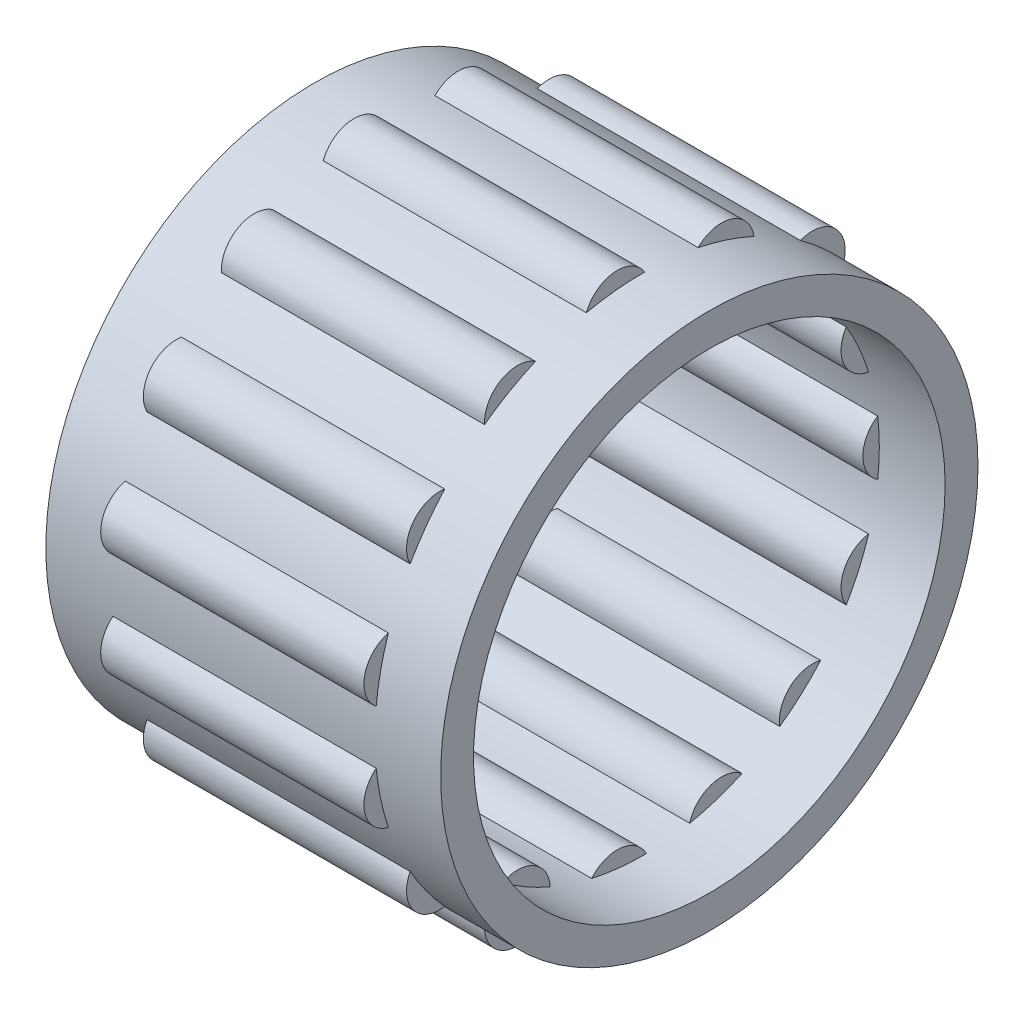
ISO-10303-21;
HEADER;
FILE_DESCRIPTION(('STEP AP214'),'2;1');
FILE_NAME('part.step','',(''),(''),'','','');
FILE_SCHEMA(('AUTOMOTIVE_DESIGN { 1 0 10303 214 1 1 1 1 }'));
ENDSEC;
DATA;
#1=APPLICATION_CONTEXT('core data for automotive mechanical design processes');
#2=APPLICATION_PROTOCOL_DEFINITION('international standard','automotive_design',2000,#1);
#3=PRODUCT_CONTEXT('',#1,'mechanical');
#4=PRODUCT('Part','Part','',(#3));
#5=PRODUCT_RELATED_PRODUCT_CATEGORY('part','',(#4));
#6=PRODUCT_DEFINITION_FORMATION('','',#4);
#7=PRODUCT_DEFINITION_CONTEXT('part definition',#1,'design');
#8=PRODUCT_DEFINITION('design','',#6,#7);
#9=PRODUCT_DEFINITION_SHAPE('','',#8);
#10=(LENGTH_UNIT() NAMED_UNIT(*) SI_UNIT(.MILLI.,.METRE.));
#11=(NAMED_UNIT(*) PLANE_ANGLE_UNIT() SI_UNIT($,.RADIAN.));
#12=(NAMED_UNIT(*) SI_UNIT($,.STERADIAN.) SOLID_ANGLE_UNIT());
#13=UNCERTAINTY_MEASURE_WITH_UNIT(LENGTH_MEASURE(1.E-05),#10,'distance_accuracy_value','');
#14=(GEOMETRIC_REPRESENTATION_CONTEXT(3) GLOBAL_UNCERTAINTY_ASSIGNED_CONTEXT((#13)) GLOBAL_UNIT_ASSIGNED_CONTEXT((#10,
#11,#12)) REPRESENTATION_CONTEXT('',''));
#15=CARTESIAN_POINT('',(0.,0.,0.));
#16=DIRECTION('',(0.,0.,1.));
#17=DIRECTION('',(1.,0.,0.));
#18=AXIS2_PLACEMENT_3D('',#15,#16,#17);
#19=CARTESIAN_POINT('',(-3.,0.,0.));
#20=DIRECTION('',(1.,0.,0.));
#21=DIRECTION('',(0.,0.,-1.));
#22=AXIS2_PLACEMENT_3D('',#19,#20,#21);
#23=PLANE('',#22);
#24=CARTESIAN_POINT('',(-3.,0.,0.));
#25=DIRECTION('',(1.,0.,0.));
#26=DIRECTION('',(0.,0.,-1.));
#27=AXIS2_PLACEMENT_3D('',#24,#25,#26);
#28=CIRCLE('',#27,5.375);
#29=CARTESIAN_POINT('',(-3.,2.74399882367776,-4.62180651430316));
#30=VERTEX_POINT('',#29);
#31=CARTESIAN_POINT('',(-3.,1.59857799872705,-5.13178072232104));
#32=VERTEX_POINT('',#31);
#33=EDGE_CURVE('E408',#30,#32,#28,.F.);
#34=ORIENTED_EDGE('',*,*,#33,.T.);
#35=CARTESIAN_POINT('',(-3.,2.338735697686,-5.252886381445));
#36=DIRECTION('',(1.,0.,0.));
#37=DIRECTION('',(0.,0.,-1.));
#38=AXIS2_PLACEMENT_3D('',#35,#36,#37);
#39=CIRCLE('',#38,0.75);
#40=EDGE_CURVE('E406',#30,#32,#39,.T.);
#41=ORIENTED_EDGE('',*,*,#40,.F.);
#42=EDGE_LOOP('',(#34,#41));
#43=FACE_BOUND('',#42,.T.);
#44=ADVANCED_FACE('F16',(#43),#23,.F.);
#45=CARTESIAN_POINT('',(3.,0.,0.));
#46=DIRECTION('',(1.,0.,0.));
#47=DIRECTION('',(0.,0.,-1.));
#48=AXIS2_PLACEMENT_3D('',#45,#46,#47);
#49=PLANE('',#48);
#50=CARTESIAN_POINT('',(3.,2.338735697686,-5.252886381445));
#51=DIRECTION('',(1.,0.,0.));
#52=DIRECTION('',(0.,0.,-1.));
#53=AXIS2_PLACEMENT_3D('',#50,#51,#52);
#54=CIRCLE('',#53,0.75);
#55=CARTESIAN_POINT('',(3.,1.59857799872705,-5.13178072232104));
#56=VERTEX_POINT('',#55);
#57=CARTESIAN_POINT('',(3.,2.74399882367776,-4.62180651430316));
#58=VERTEX_POINT('',#57);
#59=EDGE_CURVE('E20',#56,#58,#54,.F.);
#60=ORIENTED_EDGE('',*,*,#59,.F.);
#61=CARTESIAN_POINT('',(3.,0.,0.));
#62=DIRECTION('',(1.,0.,0.));
#63=DIRECTION('',(0.,0.,-1.));
#64=AXIS2_PLACEMENT_3D('',#61,#62,#63);
#65=CIRCLE('',#64,5.375);
#66=EDGE_CURVE('E393',#56,#58,#65,.T.);
#67=ORIENTED_EDGE('',*,*,#66,.T.);
#68=EDGE_LOOP('',(#60,#67));
#69=FACE_BOUND('',#68,.T.);
#70=ADVANCED_FACE('F394',(#69),#49,.T.);
#71=CARTESIAN_POINT('',(-3.,2.338735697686,-5.252886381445));
#72=DIRECTION('',(1.,0.,0.));
#73=DIRECTION('',(0.,0.,-1.));
#74=AXIS2_PLACEMENT_3D('',#71,#72,#73);
#75=CYLINDRICAL_SURFACE('',#74,0.75);
#76=ORIENTED_EDGE('',*,*,#40,.T.);
#77=DIRECTION('',(1.,0.,0.));
#78=VECTOR('',#77,1.);
#79=CARTESIAN_POINT('',(-4.5,1.59857799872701,-5.13178072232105));
#80=LINE('',#79,#78);
#81=EDGE_CURVE('E399',#32,#56,#80,.T.);
#82=ORIENTED_EDGE('',*,*,#81,.T.);
#83=ORIENTED_EDGE('',*,*,#59,.T.);
#84=DIRECTION('',(1.,0.,0.));
#85=VECTOR('',#84,1.);
#86=CARTESIAN_POINT('',(-4.5,2.74399882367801,-4.62180651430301));
#87=LINE('',#86,#85);
#88=EDGE_CURVE('E398',#58,#30,#87,.F.);
#89=ORIENTED_EDGE('',*,*,#88,.T.);
#90=EDGE_LOOP('',(#76,#82,#83,#89));
#91=FACE_BOUND('',#90,.T.);
#92=ADVANCED_FACE('F404',(#91),#75,.T.);
#93=CARTESIAN_POINT('',(-3.,0.,0.));
#94=DIRECTION('',(1.,0.,0.));
#95=DIRECTION('',(0.,0.,-1.));
#96=AXIS2_PLACEMENT_3D('',#93,#94,#95);
#97=PLANE('',#96);
#98=CARTESIAN_POINT('',(-3.,0.,0.));
#99=DIRECTION('',(1.,0.,0.));
#100=DIRECTION('',(0.,0.,-1.));
#101=AXIS2_PLACEMENT_3D('',#98,#99,#100);
#102=CIRCLE('',#101,5.375);
#103=CARTESIAN_POINT('',(-3.,4.38662572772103,-3.10614547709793));
#104=VERTEX_POINT('',#103);
#105=CARTESIAN_POINT('',(-3.,3.54765693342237,-4.03791471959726));
#106=VERTEX_POINT('',#105);
#107=EDGE_CURVE('E409',#104,#106,#102,.F.);
#108=ORIENTED_EDGE('',*,*,#107,.T.);
#109=CARTESIAN_POINT('',(-3.,4.273082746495,-3.847500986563));
#110=DIRECTION('',(1.,0.,0.));
#111=DIRECTION('',(0.,0.,-1.));
#112=AXIS2_PLACEMENT_3D('',#109,#110,#111);
#113=CIRCLE('',#112,0.75);
#114=EDGE_CURVE('E765',#104,#106,#113,.T.);
#115=ORIENTED_EDGE('',*,*,#114,.F.);
#116=EDGE_LOOP('',(#108,#115));
#117=FACE_BOUND('',#116,.T.);
#118=ADVANCED_FACE('F901',(#117),#97,.F.);
#119=CARTESIAN_POINT('',(3.,0.,0.));
#120=DIRECTION('',(1.,0.,0.));
#121=DIRECTION('',(0.,0.,-1.));
#122=AXIS2_PLACEMENT_3D('',#119,#120,#121);
#123=PLANE('',#122);
#124=CARTESIAN_POINT('',(3.,4.273082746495,-3.847500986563));
#125=DIRECTION('',(1.,0.,0.));
#126=DIRECTION('',(0.,0.,-1.));
#127=AXIS2_PLACEMENT_3D('',#124,#125,#126);
#128=CIRCLE('',#127,0.75);
#129=CARTESIAN_POINT('',(3.,3.54765693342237,-4.03791471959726));
#130=VERTEX_POINT('',#129);
#131=CARTESIAN_POINT('',(3.,4.38662572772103,-3.10614547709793));
#132=VERTEX_POINT('',#131);
#133=EDGE_CURVE('E768',#130,#132,#128,.F.);
#134=ORIENTED_EDGE('',*,*,#133,.F.);
#135=CARTESIAN_POINT('',(3.,0.,0.));
#136=DIRECTION('',(1.,0.,0.));
#137=DIRECTION('',(0.,0.,-1.));
#138=AXIS2_PLACEMENT_3D('',#135,#136,#137);
#139=CIRCLE('',#138,5.375);
#140=EDGE_CURVE('E657',#130,#132,#139,.T.);
#141=ORIENTED_EDGE('',*,*,#140,.T.);
#142=EDGE_LOOP('',(#134,#141));
#143=FACE_BOUND('',#142,.T.);
#144=ADVANCED_FACE('F903',(#143),#123,.T.);
#145=CARTESIAN_POINT('',(-3.,4.273082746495,-3.847500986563));
#146=DIRECTION('',(1.,0.,0.));
#147=DIRECTION('',(0.,0.,-1.));
#148=AXIS2_PLACEMENT_3D('',#145,#146,#147);
#149=CYLINDRICAL_SURFACE('',#148,0.75);
#150=ORIENTED_EDGE('',*,*,#114,.T.);
#151=DIRECTION('',(1.,0.,0.));
#152=VECTOR('',#151,1.);
#153=CARTESIAN_POINT('',(-4.5,3.54765693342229,-4.03791471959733));
#154=LINE('',#153,#152);
#155=EDGE_CURVE('E411',#106,#130,#154,.T.);
#156=ORIENTED_EDGE('',*,*,#155,.T.);
#157=ORIENTED_EDGE('',*,*,#133,.T.);
#158=DIRECTION('',(1.,0.,0.));
#159=VECTOR('',#158,1.);
#160=CARTESIAN_POINT('',(-4.5,4.38662572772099,-3.10614547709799));
#161=LINE('',#160,#159);
#162=EDGE_CURVE('E656',#132,#104,#161,.F.);
#163=ORIENTED_EDGE('',*,*,#162,.T.);
#164=EDGE_LOOP('',(#150,#156,#157,#163));
#165=FACE_BOUND('',#164,.T.);
#166=ADVANCED_FACE('F896',(#165),#149,.T.);
#167=CARTESIAN_POINT('',(-3.,0.,0.));
#168=DIRECTION('',(1.,0.,0.));
#169=DIRECTION('',(0.,0.,-1.));
#170=AXIS2_PLACEMENT_3D('',#167,#168,#169);
#171=PLANE('',#170);
#172=CARTESIAN_POINT('',(-3.,0.,0.));
#173=DIRECTION('',(1.,0.,0.));
#174=DIRECTION('',(0.,0.,-1.));
#175=AXIS2_PLACEMENT_3D('',#172,#173,#174);
#176=CIRCLE('',#175,5.375);
#177=CARTESIAN_POINT('',(-3.,5.27076519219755,-1.05340366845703));
#178=VERTEX_POINT('',#177);
#179=CARTESIAN_POINT('',(-3.,4.88331375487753,-2.24585657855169));
#180=VERTEX_POINT('',#179);
#181=EDGE_CURVE('E654',#178,#180,#176,.F.);
#182=ORIENTED_EDGE('',*,*,#181,.T.);
#183=CARTESIAN_POINT('',(-3.,5.468574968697,-1.776847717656));
#184=DIRECTION('',(1.,0.,0.));
#185=DIRECTION('',(0.,0.,-1.));
#186=AXIS2_PLACEMENT_3D('',#183,#184,#185);
#187=CIRCLE('',#186,0.75);
#188=EDGE_CURVE('E759',#178,#180,#187,.T.);
#189=ORIENTED_EDGE('',*,*,#188,.F.);
#190=EDGE_LOOP('',(#182,#189));
#191=FACE_BOUND('',#190,.T.);
#192=ADVANCED_FACE('F915',(#191),#171,.F.);
#193=CARTESIAN_POINT('',(3.,0.,0.));
#194=DIRECTION('',(1.,0.,0.));
#195=DIRECTION('',(0.,0.,-1.));
#196=AXIS2_PLACEMENT_3D('',#193,#194,#195);
#197=PLANE('',#196);
#198=CARTESIAN_POINT('',(3.,5.468574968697,-1.776847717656));
#199=DIRECTION('',(1.,0.,0.));
#200=DIRECTION('',(0.,0.,-1.));
#201=AXIS2_PLACEMENT_3D('',#198,#199,#200);
#202=CIRCLE('',#201,0.75);
#203=CARTESIAN_POINT('',(3.,4.88331375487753,-2.24585657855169));
#204=VERTEX_POINT('',#203);
#205=CARTESIAN_POINT('',(3.,5.27076519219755,-1.05340366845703));
#206=VERTEX_POINT('',#205);
#207=EDGE_CURVE('E762',#204,#206,#202,.F.);
#208=ORIENTED_EDGE('',*,*,#207,.F.);
#209=CARTESIAN_POINT('',(3.,0.,0.));
#210=DIRECTION('',(1.,0.,0.));
#211=DIRECTION('',(0.,0.,-1.));
#212=AXIS2_PLACEMENT_3D('',#209,#210,#211);
#213=CIRCLE('',#212,5.375);
#214=EDGE_CURVE('E651',#204,#206,#213,.T.);
#215=ORIENTED_EDGE('',*,*,#214,.T.);
#216=EDGE_LOOP('',(#208,#215));
#217=FACE_BOUND('',#216,.T.);
#218=ADVANCED_FACE('F918',(#217),#197,.T.);
#219=CARTESIAN_POINT('',(-3.,5.468574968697,-1.776847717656));
#220=DIRECTION('',(1.,0.,0.));
#221=DIRECTION('',(0.,0.,-1.));
#222=AXIS2_PLACEMENT_3D('',#219,#220,#221);
#223=CYLINDRICAL_SURFACE('',#222,0.75);
#224=ORIENTED_EDGE('',*,*,#188,.T.);
#225=DIRECTION('',(1.,0.,0.));
#226=VECTOR('',#225,1.);
#227=CARTESIAN_POINT('',(-4.5,4.8833137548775,-2.24585657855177));
#228=LINE('',#227,#226);
#229=EDGE_CURVE('E653',#180,#204,#228,.T.);
#230=ORIENTED_EDGE('',*,*,#229,.T.);
#231=ORIENTED_EDGE('',*,*,#207,.T.);
#232=DIRECTION('',(1.,0.,0.));
#233=VECTOR('',#232,1.);
#234=CARTESIAN_POINT('',(-4.5,5.27076519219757,-1.05340366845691));
#235=LINE('',#234,#233);
#236=EDGE_CURVE('E650',#206,#178,#235,.F.);
#237=ORIENTED_EDGE('',*,*,#236,.T.);
#238=EDGE_LOOP('',(#224,#230,#231,#237));
#239=FACE_BOUND('',#238,.T.);
#240=ADVANCED_FACE('F922',(#239),#223,.T.);
#241=CARTESIAN_POINT('',(-3.,0.,0.));
#242=DIRECTION('',(1.,0.,0.));
#243=DIRECTION('',(0.,0.,-1.));
#244=AXIS2_PLACEMENT_3D('',#241,#242,#243);
#245=PLANE('',#244);
#246=CARTESIAN_POINT('',(-3.,0.,0.));
#247=DIRECTION('',(1.,0.,0.));
#248=DIRECTION('',(0.,0.,-1.));
#249=AXIS2_PLACEMENT_3D('',#246,#247,#248);
#250=CIRCLE('',#249,5.375);
#251=CARTESIAN_POINT('',(-3.,5.24354147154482,1.18148120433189));
#252=VERTEX_POINT('',#251);
#253=CARTESIAN_POINT('',(-3.,5.37460126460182,-0.0654694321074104));
#254=VERTEX_POINT('',#253);
#255=EDGE_CURVE('E648',#252,#254,#250,.F.);
#256=ORIENTED_EDGE('',*,*,#255,.T.);
#257=CARTESIAN_POINT('',(-3.,5.718500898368,0.601038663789));
#258=DIRECTION('',(1.,0.,0.));
#259=DIRECTION('',(0.,0.,-1.));
#260=AXIS2_PLACEMENT_3D('',#257,#258,#259);
#261=CIRCLE('',#260,0.75);
#262=EDGE_CURVE('E753',#252,#254,#261,.T.);
#263=ORIENTED_EDGE('',*,*,#262,.F.);
#264=EDGE_LOOP('',(#256,#263));
#265=FACE_BOUND('',#264,.T.);
#266=ADVANCED_FACE('F926',(#265),#245,.F.);
#267=CARTESIAN_POINT('',(3.,0.,0.));
#268=DIRECTION('',(1.,0.,0.));
#269=DIRECTION('',(0.,0.,-1.));
#270=AXIS2_PLACEMENT_3D('',#267,#268,#269);
#271=PLANE('',#270);
#272=CARTESIAN_POINT('',(3.,5.718500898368,0.601038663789));
#273=DIRECTION('',(1.,0.,0.));
#274=DIRECTION('',(0.,0.,-1.));
#275=AXIS2_PLACEMENT_3D('',#272,#273,#274);
#276=CIRCLE('',#275,0.75);
#277=CARTESIAN_POINT('',(3.,5.37460126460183,-0.0654694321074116));
#278=VERTEX_POINT('',#277);
#279=CARTESIAN_POINT('',(3.,5.24354147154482,1.18148120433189));
#280=VERTEX_POINT('',#279);
#281=EDGE_CURVE('E756',#278,#280,#276,.F.);
#282=ORIENTED_EDGE('',*,*,#281,.F.);
#283=CARTESIAN_POINT('',(3.,0.,0.));
#284=DIRECTION('',(1.,0.,0.));
#285=DIRECTION('',(0.,0.,-1.));
#286=AXIS2_PLACEMENT_3D('',#283,#284,#285);
#287=CIRCLE('',#286,5.375);
#288=EDGE_CURVE('E645',#278,#280,#287,.T.);
#289=ORIENTED_EDGE('',*,*,#288,.T.);
#290=EDGE_LOOP('',(#282,#289));
#291=FACE_BOUND('',#290,.T.);
#292=ADVANCED_FACE('F930',(#291),#271,.T.);
#293=CARTESIAN_POINT('',(-3.,5.718500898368,0.601038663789));
#294=DIRECTION('',(1.,0.,0.));
#295=DIRECTION('',(0.,0.,-1.));
#296=AXIS2_PLACEMENT_3D('',#293,#294,#295);
#297=CYLINDRICAL_SURFACE('',#296,0.75);
#298=ORIENTED_EDGE('',*,*,#262,.T.);
#299=DIRECTION('',(1.,0.,0.));
#300=VECTOR('',#299,1.);
#301=CARTESIAN_POINT('',(-4.5,5.37460126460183,-0.0654694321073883));
#302=LINE('',#301,#300);
#303=EDGE_CURVE('E647',#254,#278,#302,.T.);
#304=ORIENTED_EDGE('',*,*,#303,.T.);
#305=ORIENTED_EDGE('',*,*,#281,.T.);
#306=DIRECTION('',(1.,0.,0.));
#307=VECTOR('',#306,1.);
#308=CARTESIAN_POINT('',(-4.5,5.24354147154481,1.18148120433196));
#309=LINE('',#308,#307);
#310=EDGE_CURVE('E644',#280,#252,#309,.F.);
#311=ORIENTED_EDGE('',*,*,#310,.T.);
#312=EDGE_LOOP('',(#298,#304,#305,#311));
#313=FACE_BOUND('',#312,.T.);
#314=ADVANCED_FACE('F934',(#313),#297,.T.);
#315=CARTESIAN_POINT('',(-3.,0.,0.));
#316=DIRECTION('',(1.,0.,0.));
#317=DIRECTION('',(0.,0.,-1.));
#318=AXIS2_PLACEMENT_3D('',#315,#316,#317);
#319=PLANE('',#318);
#320=CARTESIAN_POINT('',(-3.,0.,0.));
#321=DIRECTION('',(1.,0.,0.));
#322=DIRECTION('',(0.,0.,-1.));
#323=AXIS2_PLACEMENT_3D('',#320,#321,#322);
#324=CIRCLE('',#323,5.375);
#325=CARTESIAN_POINT('',(-3.,4.30966179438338,3.21207724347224));
#326=VERTEX_POINT('',#325);
#327=CARTESIAN_POINT('',(-3.,4.93657138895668,2.1262379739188));
#328=VERTEX_POINT('',#327);
#329=EDGE_CURVE('E642',#326,#328,#324,.F.);
#330=ORIENTED_EDGE('',*,*,#329,.T.);
#331=CARTESIAN_POINT('',(-3.,4.979646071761,2.875));
#332=DIRECTION('',(1.,0.,0.));
#333=DIRECTION('',(0.,0.,-1.));
#334=AXIS2_PLACEMENT_3D('',#331,#332,#333);
#335=CIRCLE('',#334,0.75);
#336=EDGE_CURVE('E747',#326,#328,#335,.T.);
#337=ORIENTED_EDGE('',*,*,#336,.F.);
#338=EDGE_LOOP('',(#330,#337));
#339=FACE_BOUND('',#338,.T.);
#340=ADVANCED_FACE('F938',(#339),#319,.F.);
#341=CARTESIAN_POINT('',(3.,0.,0.));
#342=DIRECTION('',(1.,0.,0.));
#343=DIRECTION('',(0.,0.,-1.));
#344=AXIS2_PLACEMENT_3D('',#341,#342,#343);
#345=PLANE('',#344);
#346=CARTESIAN_POINT('',(3.,4.979646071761,2.875));
#347=DIRECTION('',(1.,0.,0.));
#348=DIRECTION('',(0.,0.,-1.));
#349=AXIS2_PLACEMENT_3D('',#346,#347,#348);
#350=CIRCLE('',#349,0.75);
#351=CARTESIAN_POINT('',(3.,4.93657138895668,2.1262379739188));
#352=VERTEX_POINT('',#351);
#353=CARTESIAN_POINT('',(3.,4.30966179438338,3.21207724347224));
#354=VERTEX_POINT('',#353);
#355=EDGE_CURVE('E750',#352,#354,#350,.F.);
#356=ORIENTED_EDGE('',*,*,#355,.F.);
#357=CARTESIAN_POINT('',(3.,0.,0.));
#358=DIRECTION('',(1.,0.,0.));
#359=DIRECTION('',(0.,0.,-1.));
#360=AXIS2_PLACEMENT_3D('',#357,#358,#359);
#361=CIRCLE('',#360,5.375);
#362=EDGE_CURVE('E639',#352,#354,#361,.T.);
#363=ORIENTED_EDGE('',*,*,#362,.T.);
#364=EDGE_LOOP('',(#356,#363));
#365=FACE_BOUND('',#364,.T.);
#366=ADVANCED_FACE('F942',(#365),#345,.T.);
#367=CARTESIAN_POINT('',(-3.,4.979646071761,2.875));
#368=DIRECTION('',(1.,0.,0.));
#369=DIRECTION('',(0.,0.,-1.));
#370=AXIS2_PLACEMENT_3D('',#367,#368,#369);
#371=CYLINDRICAL_SURFACE('',#370,0.75);
#372=ORIENTED_EDGE('',*,*,#336,.T.);
#373=DIRECTION('',(1.,0.,0.));
#374=VECTOR('',#373,1.);
#375=CARTESIAN_POINT('',(-4.5,4.93657138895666,2.12623797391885));
#376=LINE('',#375,#374);
#377=EDGE_CURVE('E641',#328,#352,#376,.T.);
#378=ORIENTED_EDGE('',*,*,#377,.T.);
#379=ORIENTED_EDGE('',*,*,#355,.T.);
#380=DIRECTION('',(1.,0.,0.));
#381=VECTOR('',#380,1.);
#382=CARTESIAN_POINT('',(-4.5,4.30966179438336,3.21207724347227));
#383=LINE('',#382,#381);
#384=EDGE_CURVE('E638',#354,#326,#383,.F.);
#385=ORIENTED_EDGE('',*,*,#384,.T.);
#386=EDGE_LOOP('',(#372,#378,#379,#385));
#387=FACE_BOUND('',#386,.T.);
#388=ADVANCED_FACE('F946',(#387),#371,.T.);
#389=CARTESIAN_POINT('',(-3.,0.,0.));
#390=DIRECTION('',(1.,0.,0.));
#391=DIRECTION('',(0.,0.,-1.));
#392=AXIS2_PLACEMENT_3D('',#389,#390,#391);
#393=PLANE('',#392);
#394=CARTESIAN_POINT('',(-3.,0.,0.));
#395=DIRECTION('',(1.,0.,0.));
#396=DIRECTION('',(0.,0.,-1.));
#397=AXIS2_PLACEMENT_3D('',#394,#395,#396);
#398=CIRCLE('',#397,5.375);
#399=CARTESIAN_POINT('',(-3.,2.63060244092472,4.68727594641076));
#400=VERTEX_POINT('',#399);
#401=CARTESIAN_POINT('',(-3.,3.64496347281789,3.9502995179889));
#402=VERTEX_POINT('',#401);
#403=EDGE_CURVE('E636',#400,#402,#398,.F.);
#404=ORIENTED_EDGE('',*,*,#403,.T.);
#405=CARTESIAN_POINT('',(-3.,3.379765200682,4.651847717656));
#406=DIRECTION('',(1.,0.,0.));
#407=DIRECTION('',(0.,0.,-1.));
#408=AXIS2_PLACEMENT_3D('',#405,#406,#407);
#409=CIRCLE('',#408,0.75);
#410=EDGE_CURVE('E741',#400,#402,#409,.T.);
#411=ORIENTED_EDGE('',*,*,#410,.F.);
#412=EDGE_LOOP('',(#404,#411));
#413=FACE_BOUND('',#412,.T.);
#414=ADVANCED_FACE('F950',(#413),#393,.F.);
#415=CARTESIAN_POINT('',(3.,0.,0.));
#416=DIRECTION('',(1.,0.,0.));
#417=DIRECTION('',(0.,0.,-1.));
#418=AXIS2_PLACEMENT_3D('',#415,#416,#417);
#419=PLANE('',#418);
#420=CARTESIAN_POINT('',(3.,3.379765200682,4.651847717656));
#421=DIRECTION('',(1.,0.,0.));
#422=DIRECTION('',(0.,0.,-1.));
#423=AXIS2_PLACEMENT_3D('',#420,#421,#422);
#424=CIRCLE('',#423,0.75);
#425=CARTESIAN_POINT('',(3.,3.64496347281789,3.9502995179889));
#426=VERTEX_POINT('',#425);
#427=CARTESIAN_POINT('',(3.,2.63060244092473,4.68727594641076));
#428=VERTEX_POINT('',#427);
#429=EDGE_CURVE('E744',#426,#428,#424,.F.);
#430=ORIENTED_EDGE('',*,*,#429,.F.);
#431=CARTESIAN_POINT('',(3.,0.,0.));
#432=DIRECTION('',(1.,0.,0.));
#433=DIRECTION('',(0.,0.,-1.));
#434=AXIS2_PLACEMENT_3D('',#431,#432,#433);
#435=CIRCLE('',#434,5.375);
#436=EDGE_CURVE('E633',#426,#428,#435,.T.);
#437=ORIENTED_EDGE('',*,*,#436,.T.);
#438=EDGE_LOOP('',(#430,#437));
#439=FACE_BOUND('',#438,.T.);
#440=ADVANCED_FACE('F954',(#439),#419,.T.);
#441=CARTESIAN_POINT('',(-3.,3.379765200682,4.651847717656));
#442=DIRECTION('',(1.,0.,0.));
#443=DIRECTION('',(0.,0.,-1.));
#444=AXIS2_PLACEMENT_3D('',#441,#442,#443);
#445=CYLINDRICAL_SURFACE('',#444,0.75);
#446=ORIENTED_EDGE('',*,*,#410,.T.);
#447=DIRECTION('',(1.,0.,0.));
#448=VECTOR('',#447,1.);
#449=CARTESIAN_POINT('',(-4.5,3.6449634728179,3.95029951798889));
#450=LINE('',#449,#448);
#451=EDGE_CURVE('E635',#402,#426,#450,.T.);
#452=ORIENTED_EDGE('',*,*,#451,.T.);
#453=ORIENTED_EDGE('',*,*,#429,.T.);
#454=DIRECTION('',(1.,0.,0.));
#455=VECTOR('',#454,1.);
#456=CARTESIAN_POINT('',(-4.5,2.63060244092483,4.6872759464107));
#457=LINE('',#456,#455);
#458=EDGE_CURVE('E632',#428,#400,#457,.F.);
#459=ORIENTED_EDGE('',*,*,#458,.T.);
#460=EDGE_LOOP('',(#446,#452,#453,#459));
#461=FACE_BOUND('',#460,.T.);
#462=ADVANCED_FACE('F958',(#461),#445,.T.);
#463=CARTESIAN_POINT('',(-3.,0.,0.));
#464=DIRECTION('',(1.,0.,0.));
#465=DIRECTION('',(0.,0.,-1.));
#466=AXIS2_PLACEMENT_3D('',#463,#464,#465);
#467=PLANE('',#466);
#468=CARTESIAN_POINT('',(-3.,0.,0.));
#469=DIRECTION('',(1.,0.,0.));
#470=DIRECTION('',(0.,0.,-1.));
#471=AXIS2_PLACEMENT_3D('',#468,#469,#470);
#472=CIRCLE('',#471,5.375);
#473=CARTESIAN_POINT('',(-3.,0.496688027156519,5.35200205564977));
#474=VERTEX_POINT('',#473);
#475=CARTESIAN_POINT('',(-3.,1.72310825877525,5.09131838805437));
#476=VERTEX_POINT('',#475);
#477=EDGE_CURVE('E630',#474,#476,#472,.F.);
#478=ORIENTED_EDGE('',*,*,#477,.T.);
#479=CARTESIAN_POINT('',(-3.,1.195492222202,5.624348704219));
#480=DIRECTION('',(1.,0.,0.));
#481=DIRECTION('',(0.,0.,-1.));
#482=AXIS2_PLACEMENT_3D('',#479,#480,#481);
#483=CIRCLE('',#482,0.75);
#484=EDGE_CURVE('E735',#474,#476,#483,.T.);
#485=ORIENTED_EDGE('',*,*,#484,.F.);
#486=EDGE_LOOP('',(#478,#485));
#487=FACE_BOUND('',#486,.T.);
#488=ADVANCED_FACE('F962',(#487),#467,.F.);
#489=CARTESIAN_POINT('',(3.,0.,0.));
#490=DIRECTION('',(1.,0.,0.));
#491=DIRECTION('',(0.,0.,-1.));
#492=AXIS2_PLACEMENT_3D('',#489,#490,#491);
#493=PLANE('',#492);
#494=CARTESIAN_POINT('',(3.,1.195492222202,5.624348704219));
#495=DIRECTION('',(1.,0.,0.));
#496=DIRECTION('',(0.,0.,-1.));
#497=AXIS2_PLACEMENT_3D('',#494,#495,#496);
#498=CIRCLE('',#497,0.75);
#499=CARTESIAN_POINT('',(3.,1.72310825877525,5.09131838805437));
#500=VERTEX_POINT('',#499);
#501=CARTESIAN_POINT('',(3.,0.49668802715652,5.35200205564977));
#502=VERTEX_POINT('',#501);
#503=EDGE_CURVE('E738',#500,#502,#498,.F.);
#504=ORIENTED_EDGE('',*,*,#503,.F.);
#505=CARTESIAN_POINT('',(3.,0.,0.));
#506=DIRECTION('',(1.,0.,0.));
#507=DIRECTION('',(0.,0.,-1.));
#508=AXIS2_PLACEMENT_3D('',#505,#506,#507);
#509=CIRCLE('',#508,5.375);
#510=EDGE_CURVE('E627',#500,#502,#509,.T.);
#511=ORIENTED_EDGE('',*,*,#510,.T.);
#512=EDGE_LOOP('',(#504,#511));
#513=FACE_BOUND('',#512,.T.);
#514=ADVANCED_FACE('F966',(#513),#493,.T.);
#515=CARTESIAN_POINT('',(-3.,1.195492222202,5.624348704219));
#516=DIRECTION('',(1.,0.,0.));
#517=DIRECTION('',(0.,0.,-1.));
#518=AXIS2_PLACEMENT_3D('',#515,#516,#517);
#519=CYLINDRICAL_SURFACE('',#518,0.75);
#520=ORIENTED_EDGE('',*,*,#484,.T.);
#521=DIRECTION('',(1.,0.,0.));
#522=VECTOR('',#521,1.);
#523=CARTESIAN_POINT('',(-4.5,1.72310825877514,5.09131838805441));
#524=LINE('',#523,#522);
#525=EDGE_CURVE('E629',#476,#500,#524,.T.);
#526=ORIENTED_EDGE('',*,*,#525,.T.);
#527=ORIENTED_EDGE('',*,*,#503,.T.);
#528=DIRECTION('',(1.,0.,0.));
#529=VECTOR('',#528,1.);
#530=CARTESIAN_POINT('',(-4.5,0.496688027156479,5.35200205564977));
#531=LINE('',#530,#529);
#532=EDGE_CURVE('E626',#502,#474,#531,.F.);
#533=ORIENTED_EDGE('',*,*,#532,.T.);
#534=EDGE_LOOP('',(#520,#526,#527,#533));
#535=FACE_BOUND('',#534,.T.);
#536=ADVANCED_FACE('F970',(#535),#519,.T.);
#537=CARTESIAN_POINT('',(-3.,0.,0.));
#538=DIRECTION('',(1.,0.,0.));
#539=DIRECTION('',(0.,0.,-1.));
#540=AXIS2_PLACEMENT_3D('',#537,#538,#539);
#541=PLANE('',#540);
#542=CARTESIAN_POINT('',(-3.,0.,-5.75));
#543=DIRECTION('',(1.,0.,0.));
#544=DIRECTION('',(0.,0.,-1.));
#545=AXIS2_PLACEMENT_3D('',#542,#543,#544);
#546=CIRCLE('',#545,0.75);
#547=CARTESIAN_POINT('',(-3.,0.626909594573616,-5.3383152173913));
#548=VERTEX_POINT('',#547);
#549=CARTESIAN_POINT('',(-3.,-0.626909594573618,-5.3383152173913));
#550=VERTEX_POINT('',#549);
#551=EDGE_CURVE('E732',#548,#550,#546,.T.);
#552=ORIENTED_EDGE('',*,*,#551,.F.);
#553=CARTESIAN_POINT('',(-3.,0.,0.));
#554=DIRECTION('',(1.,0.,0.));
#555=DIRECTION('',(0.,0.,-1.));
#556=AXIS2_PLACEMENT_3D('',#553,#554,#555);
#557=CIRCLE('',#556,5.375);
#558=EDGE_CURVE('E624',#548,#550,#557,.F.);
#559=ORIENTED_EDGE('',*,*,#558,.T.);
#560=EDGE_LOOP('',(#552,#559));
#561=FACE_BOUND('',#560,.T.);
#562=ADVANCED_FACE('F974',(#561),#541,.F.);
#563=CARTESIAN_POINT('',(-3.,0.,-5.75));
#564=DIRECTION('',(1.,0.,0.));
#565=DIRECTION('',(0.,0.,-1.));
#566=AXIS2_PLACEMENT_3D('',#563,#564,#565);
#567=CYLINDRICAL_SURFACE('',#566,0.75);
#568=ORIENTED_EDGE('',*,*,#551,.T.);
#569=DIRECTION('',(1.,0.,0.));
#570=VECTOR('',#569,1.);
#571=CARTESIAN_POINT('',(-4.5,-0.626909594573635,-5.3383152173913));
#572=LINE('',#571,#570);
#573=CARTESIAN_POINT('',(3.,-0.626909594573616,-5.3383152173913));
#574=VERTEX_POINT('',#573);
#575=EDGE_CURVE('E623',#550,#574,#572,.T.);
#576=ORIENTED_EDGE('',*,*,#575,.T.);
#577=CARTESIAN_POINT('',(3.,0.,-5.75));
#578=DIRECTION('',(1.,0.,0.));
#579=DIRECTION('',(0.,0.,-1.));
#580=AXIS2_PLACEMENT_3D('',#577,#578,#579);
#581=CIRCLE('',#580,0.75);
#582=CARTESIAN_POINT('',(3.,0.626909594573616,-5.3383152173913));
#583=VERTEX_POINT('',#582);
#584=EDGE_CURVE('E729',#583,#574,#581,.T.);
#585=ORIENTED_EDGE('',*,*,#584,.F.);
#586=DIRECTION('',(1.,0.,0.));
#587=VECTOR('',#586,1.);
#588=CARTESIAN_POINT('',(-4.5,0.626909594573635,-5.3383152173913));
#589=LINE('',#588,#587);
#590=EDGE_CURVE('E416',#583,#548,#589,.F.);
#591=ORIENTED_EDGE('',*,*,#590,.T.);
#592=EDGE_LOOP('',(#568,#576,#585,#591));
#593=FACE_BOUND('',#592,.T.);
#594=ADVANCED_FACE('F978',(#593),#567,.T.);
#595=CARTESIAN_POINT('',(3.,0.,0.));
#596=DIRECTION('',(1.,0.,0.));
#597=DIRECTION('',(0.,0.,-1.));
#598=AXIS2_PLACEMENT_3D('',#595,#596,#597);
#599=PLANE('',#598);
#600=ORIENTED_EDGE('',*,*,#584,.T.);
#601=CARTESIAN_POINT('',(3.,0.,0.));
#602=DIRECTION('',(1.,0.,0.));
#603=DIRECTION('',(0.,0.,-1.));
#604=AXIS2_PLACEMENT_3D('',#601,#602,#603);
#605=CIRCLE('',#604,5.375);
#606=EDGE_CURVE('E621',#574,#583,#605,.T.);
#607=ORIENTED_EDGE('',*,*,#606,.T.);
#608=EDGE_LOOP('',(#600,#607));
#609=FACE_BOUND('',#608,.T.);
#610=ADVANCED_FACE('F982',(#609),#599,.T.);
#611=CARTESIAN_POINT('',(-3.,0.,0.));
#612=DIRECTION('',(1.,0.,0.));
#613=DIRECTION('',(0.,0.,-1.));
#614=AXIS2_PLACEMENT_3D('',#611,#612,#613);
#615=PLANE('',#614);
#616=CARTESIAN_POINT('',(-3.,0.,0.));
#617=DIRECTION('',(1.,0.,0.));
#618=DIRECTION('',(0.,0.,-1.));
#619=AXIS2_PLACEMENT_3D('',#616,#617,#618);
#620=CIRCLE('',#619,5.375);
#621=CARTESIAN_POINT('',(-3.,-1.72310825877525,5.09131838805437));
#622=VERTEX_POINT('',#621);
#623=CARTESIAN_POINT('',(-3.,-0.496688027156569,5.35200205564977));
#624=VERTEX_POINT('',#623);
#625=EDGE_CURVE('E619',#622,#624,#620,.F.);
#626=ORIENTED_EDGE('',*,*,#625,.T.);
#627=CARTESIAN_POINT('',(-3.,-1.195492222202,5.624348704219));
#628=DIRECTION('',(1.,0.,0.));
#629=DIRECTION('',(0.,0.,-1.));
#630=AXIS2_PLACEMENT_3D('',#627,#628,#629);
#631=CIRCLE('',#630,0.75);
#632=EDGE_CURVE('E723',#622,#624,#631,.T.);
#633=ORIENTED_EDGE('',*,*,#632,.F.);
#634=EDGE_LOOP('',(#626,#633));
#635=FACE_BOUND('',#634,.T.);
#636=ADVANCED_FACE('F986',(#635),#615,.F.);
#637=CARTESIAN_POINT('',(3.,0.,0.));
#638=DIRECTION('',(1.,0.,0.));
#639=DIRECTION('',(0.,0.,-1.));
#640=AXIS2_PLACEMENT_3D('',#637,#638,#639);
#641=PLANE('',#640);
#642=CARTESIAN_POINT('',(3.,-1.195492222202,5.624348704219));
#643=DIRECTION('',(1.,0.,0.));
#644=DIRECTION('',(0.,0.,-1.));
#645=AXIS2_PLACEMENT_3D('',#642,#643,#644);
#646=CIRCLE('',#645,0.75);
#647=CARTESIAN_POINT('',(3.,-0.496688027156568,5.35200205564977));
#648=VERTEX_POINT('',#647);
#649=CARTESIAN_POINT('',(3.,-1.72310825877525,5.09131838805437));
#650=VERTEX_POINT('',#649);
#651=EDGE_CURVE('E726',#648,#650,#646,.F.);
#652=ORIENTED_EDGE('',*,*,#651,.F.);
#653=CARTESIAN_POINT('',(3.,0.,0.));
#654=DIRECTION('',(1.,0.,0.));
#655=DIRECTION('',(0.,0.,-1.));
#656=AXIS2_PLACEMENT_3D('',#653,#654,#655);
#657=CIRCLE('',#656,5.375);
#658=EDGE_CURVE('E616',#648,#650,#657,.T.);
#659=ORIENTED_EDGE('',*,*,#658,.T.);
#660=EDGE_LOOP('',(#652,#659));
#661=FACE_BOUND('',#660,.T.);
#662=ADVANCED_FACE('F990',(#661),#641,.T.);
#663=CARTESIAN_POINT('',(-3.,-1.195492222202,5.624348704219));
#664=DIRECTION('',(1.,0.,0.));
#665=DIRECTION('',(0.,0.,-1.));
#666=AXIS2_PLACEMENT_3D('',#663,#664,#665);
#667=CYLINDRICAL_SURFACE('',#666,0.75);
#668=ORIENTED_EDGE('',*,*,#632,.T.);
#669=DIRECTION('',(1.,0.,0.));
#670=VECTOR('',#669,1.);
#671=CARTESIAN_POINT('',(-4.5,-0.496688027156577,5.35200205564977));
#672=LINE('',#671,#670);
#673=EDGE_CURVE('E618',#624,#648,#672,.T.);
#674=ORIENTED_EDGE('',*,*,#673,.T.);
#675=ORIENTED_EDGE('',*,*,#651,.T.);
#676=DIRECTION('',(1.,0.,0.));
#677=VECTOR('',#676,1.);
#678=CARTESIAN_POINT('',(-4.5,-1.72310825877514,5.09131838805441));
#679=LINE('',#678,#677);
#680=EDGE_CURVE('E615',#650,#622,#679,.F.);
#681=ORIENTED_EDGE('',*,*,#680,.T.);
#682=EDGE_LOOP('',(#668,#674,#675,#681));
#683=FACE_BOUND('',#682,.T.);
#684=ADVANCED_FACE('F994',(#683),#667,.T.);
#685=CARTESIAN_POINT('',(-3.,0.,0.));
#686=DIRECTION('',(1.,0.,0.));
#687=DIRECTION('',(0.,0.,-1.));
#688=AXIS2_PLACEMENT_3D('',#685,#686,#687);
#689=PLANE('',#688);
#690=CARTESIAN_POINT('',(-3.,0.,0.));
#691=DIRECTION('',(1.,0.,0.));
#692=DIRECTION('',(0.,0.,-1.));
#693=AXIS2_PLACEMENT_3D('',#690,#691,#692);
#694=CIRCLE('',#693,5.375);
#695=CARTESIAN_POINT('',(-3.,-3.64496347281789,3.9502995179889));
#696=VERTEX_POINT('',#695);
#697=CARTESIAN_POINT('',(-3.,-2.63060244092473,4.68727594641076));
#698=VERTEX_POINT('',#697);
#699=EDGE_CURVE('E613',#696,#698,#694,.F.);
#700=ORIENTED_EDGE('',*,*,#699,.T.);
#701=CARTESIAN_POINT('',(-3.,-3.379765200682,4.651847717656));
#702=DIRECTION('',(1.,0.,0.));
#703=DIRECTION('',(0.,0.,-1.));
#704=AXIS2_PLACEMENT_3D('',#701,#702,#703);
#705=CIRCLE('',#704,0.75);
#706=EDGE_CURVE('E717',#696,#698,#705,.T.);
#707=ORIENTED_EDGE('',*,*,#706,.F.);
#708=EDGE_LOOP('',(#700,#707));
#709=FACE_BOUND('',#708,.T.);
#710=ADVANCED_FACE('F998',(#709),#689,.F.);
#711=CARTESIAN_POINT('',(3.,0.,0.));
#712=DIRECTION('',(1.,0.,0.));
#713=DIRECTION('',(0.,0.,-1.));
#714=AXIS2_PLACEMENT_3D('',#711,#712,#713);
#715=PLANE('',#714);
#716=CARTESIAN_POINT('',(3.,-3.379765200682,4.651847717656));
#717=DIRECTION('',(1.,0.,0.));
#718=DIRECTION('',(0.,0.,-1.));
#719=AXIS2_PLACEMENT_3D('',#716,#717,#718);
#720=CIRCLE('',#719,0.75);
#721=CARTESIAN_POINT('',(3.,-2.63060244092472,4.68727594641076));
#722=VERTEX_POINT('',#721);
#723=CARTESIAN_POINT('',(3.,-3.64496347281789,3.9502995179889));
#724=VERTEX_POINT('',#723);
#725=EDGE_CURVE('E720',#722,#724,#720,.F.);
#726=ORIENTED_EDGE('',*,*,#725,.F.);
#727=CARTESIAN_POINT('',(3.,0.,0.));
#728=DIRECTION('',(1.,0.,0.));
#729=DIRECTION('',(0.,0.,-1.));
#730=AXIS2_PLACEMENT_3D('',#727,#728,#729);
#731=CIRCLE('',#730,5.375);
#732=EDGE_CURVE('E610',#722,#724,#731,.T.);
#733=ORIENTED_EDGE('',*,*,#732,.T.);
#734=EDGE_LOOP('',(#726,#733));
#735=FACE_BOUND('',#734,.T.);
#736=ADVANCED_FACE('F1002',(#735),#715,.T.);
#737=CARTESIAN_POINT('',(-3.,-3.379765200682,4.651847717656));
#738=DIRECTION('',(1.,0.,0.));
#739=DIRECTION('',(0.,0.,-1.));
#740=AXIS2_PLACEMENT_3D('',#737,#738,#739);
#741=CYLINDRICAL_SURFACE('',#740,0.75);
#742=ORIENTED_EDGE('',*,*,#706,.T.);
#743=DIRECTION('',(1.,0.,0.));
#744=VECTOR('',#743,1.);
#745=CARTESIAN_POINT('',(-4.5,-2.63060244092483,4.6872759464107));
#746=LINE('',#745,#744);
#747=EDGE_CURVE('E612',#698,#722,#746,.T.);
#748=ORIENTED_EDGE('',*,*,#747,.T.);
#749=ORIENTED_EDGE('',*,*,#725,.T.);
#750=DIRECTION('',(1.,0.,0.));
#751=VECTOR('',#750,1.);
#752=CARTESIAN_POINT('',(-4.5,-3.6449634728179,3.95029951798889));
#753=LINE('',#752,#751);
#754=EDGE_CURVE('E609',#724,#696,#753,.F.);
#755=ORIENTED_EDGE('',*,*,#754,.T.);
#756=EDGE_LOOP('',(#742,#748,#749,#755));
#757=FACE_BOUND('',#756,.T.);
#758=ADVANCED_FACE('F1006',(#757),#741,.T.);
#759=CARTESIAN_POINT('',(-3.,0.,0.));
#760=DIRECTION('',(1.,0.,0.));
#761=DIRECTION('',(0.,0.,-1.));
#762=AXIS2_PLACEMENT_3D('',#759,#760,#761);
#763=PLANE('',#762);
#764=CARTESIAN_POINT('',(-3.,0.,0.));
#765=DIRECTION('',(1.,0.,0.));
#766=DIRECTION('',(0.,0.,-1.));
#767=AXIS2_PLACEMENT_3D('',#764,#765,#766);
#768=CIRCLE('',#767,5.375);
#769=CARTESIAN_POINT('',(-3.,-4.93657138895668,2.1262379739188));
#770=VERTEX_POINT('',#769);
#771=CARTESIAN_POINT('',(-3.,-4.30966179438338,3.21207724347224));
#772=VERTEX_POINT('',#771);
#773=EDGE_CURVE('E607',#770,#772,#768,.F.);
#774=ORIENTED_EDGE('',*,*,#773,.T.);
#775=CARTESIAN_POINT('',(-3.,-4.979646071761,2.875));
#776=DIRECTION('',(1.,0.,0.));
#777=DIRECTION('',(0.,0.,-1.));
#778=AXIS2_PLACEMENT_3D('',#775,#776,#777);
#779=CIRCLE('',#778,0.75);
#780=EDGE_CURVE('E711',#770,#772,#779,.T.);
#781=ORIENTED_EDGE('',*,*,#780,.F.);
#782=EDGE_LOOP('',(#774,#781));
#783=FACE_BOUND('',#782,.T.);
#784=ADVANCED_FACE('F1010',(#783),#763,.F.);
#785=CARTESIAN_POINT('',(3.,0.,0.));
#786=DIRECTION('',(1.,0.,0.));
#787=DIRECTION('',(0.,0.,-1.));
#788=AXIS2_PLACEMENT_3D('',#785,#786,#787);
#789=PLANE('',#788);
#790=CARTESIAN_POINT('',(3.,-4.979646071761,2.875));
#791=DIRECTION('',(1.,0.,0.));
#792=DIRECTION('',(0.,0.,-1.));
#793=AXIS2_PLACEMENT_3D('',#790,#791,#792);
#794=CIRCLE('',#793,0.75);
#795=CARTESIAN_POINT('',(3.,-4.30966179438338,3.21207724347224));
#796=VERTEX_POINT('',#795);
#797=CARTESIAN_POINT('',(3.,-4.93657138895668,2.1262379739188));
#798=VERTEX_POINT('',#797);
#799=EDGE_CURVE('E714',#796,#798,#794,.F.);
#800=ORIENTED_EDGE('',*,*,#799,.F.);
#801=CARTESIAN_POINT('',(3.,0.,0.));
#802=DIRECTION('',(1.,0.,0.));
#803=DIRECTION('',(0.,0.,-1.));
#804=AXIS2_PLACEMENT_3D('',#801,#802,#803);
#805=CIRCLE('',#804,5.375);
#806=EDGE_CURVE('E604',#796,#798,#805,.T.);
#807=ORIENTED_EDGE('',*,*,#806,.T.);
#808=EDGE_LOOP('',(#800,#807));
#809=FACE_BOUND('',#808,.T.);
#810=ADVANCED_FACE('F1014',(#809),#789,.T.);
#811=CARTESIAN_POINT('',(-3.,-4.979646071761,2.875));
#812=DIRECTION('',(1.,0.,0.));
#813=DIRECTION('',(0.,0.,-1.));
#814=AXIS2_PLACEMENT_3D('',#811,#812,#813);
#815=CYLINDRICAL_SURFACE('',#814,0.75);
#816=ORIENTED_EDGE('',*,*,#780,.T.);
#817=DIRECTION('',(1.,0.,0.));
#818=VECTOR('',#817,1.);
#819=CARTESIAN_POINT('',(-4.5,-4.30966179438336,3.21207724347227));
#820=LINE('',#819,#818);
#821=EDGE_CURVE('E606',#772,#796,#820,.T.);
#822=ORIENTED_EDGE('',*,*,#821,.T.);
#823=ORIENTED_EDGE('',*,*,#799,.T.);
#824=DIRECTION('',(1.,0.,0.));
#825=VECTOR('',#824,1.);
#826=CARTESIAN_POINT('',(-4.5,-4.93657138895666,2.12623797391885));
#827=LINE('',#826,#825);
#828=EDGE_CURVE('E603',#798,#770,#827,.F.);
#829=ORIENTED_EDGE('',*,*,#828,.T.);
#830=EDGE_LOOP('',(#816,#822,#823,#829));
#831=FACE_BOUND('',#830,.T.);
#832=ADVANCED_FACE('F1018',(#831),#815,.T.);
#833=CARTESIAN_POINT('',(-3.,0.,0.));
#834=DIRECTION('',(1.,0.,0.));
#835=DIRECTION('',(0.,0.,-1.));
#836=AXIS2_PLACEMENT_3D('',#833,#834,#835);
#837=PLANE('',#836);
#838=CARTESIAN_POINT('',(-3.,0.,0.));
#839=DIRECTION('',(1.,0.,0.));
#840=DIRECTION('',(0.,0.,-1.));
#841=AXIS2_PLACEMENT_3D('',#838,#839,#840);
#842=CIRCLE('',#841,5.375);
#843=CARTESIAN_POINT('',(-3.,-5.37460126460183,-0.0654694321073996));
#844=VERTEX_POINT('',#843);
#845=CARTESIAN_POINT('',(-3.,-5.24354147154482,1.18148120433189));
#846=VERTEX_POINT('',#845);
#847=EDGE_CURVE('E601',#844,#846,#842,.F.);
#848=ORIENTED_EDGE('',*,*,#847,.T.);
#849=CARTESIAN_POINT('',(-3.,-5.718500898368,0.601038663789));
#850=DIRECTION('',(1.,0.,0.));
#851=DIRECTION('',(0.,0.,-1.));
#852=AXIS2_PLACEMENT_3D('',#849,#850,#851);
#853=CIRCLE('',#852,0.75);
#854=EDGE_CURVE('E705',#844,#846,#853,.T.);
#855=ORIENTED_EDGE('',*,*,#854,.F.);
#856=EDGE_LOOP('',(#848,#855));
#857=FACE_BOUND('',#856,.T.);
#858=ADVANCED_FACE('F1022',(#857),#837,.F.);
#859=CARTESIAN_POINT('',(3.,0.,0.));
#860=DIRECTION('',(1.,0.,0.));
#861=DIRECTION('',(0.,0.,-1.));
#862=AXIS2_PLACEMENT_3D('',#859,#860,#861);
#863=PLANE('',#862);
#864=CARTESIAN_POINT('',(3.,-5.718500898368,0.601038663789));
#865=DIRECTION('',(1.,0.,0.));
#866=DIRECTION('',(0.,0.,-1.));
#867=AXIS2_PLACEMENT_3D('',#864,#865,#866);
#868=CIRCLE('',#867,0.75);
#869=CARTESIAN_POINT('',(3.,-5.24354147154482,1.18148120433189));
#870=VERTEX_POINT('',#869);
#871=CARTESIAN_POINT('',(3.,-5.37460126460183,-0.0654694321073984));
#872=VERTEX_POINT('',#871);
#873=EDGE_CURVE('E708',#870,#872,#868,.F.);
#874=ORIENTED_EDGE('',*,*,#873,.F.);
#875=CARTESIAN_POINT('',(3.,0.,0.));
#876=DIRECTION('',(1.,0.,0.));
#877=DIRECTION('',(0.,0.,-1.));
#878=AXIS2_PLACEMENT_3D('',#875,#876,#877);
#879=CIRCLE('',#878,5.375);
#880=EDGE_CURVE('E598',#870,#872,#879,.T.);
#881=ORIENTED_EDGE('',*,*,#880,.T.);
#882=EDGE_LOOP('',(#874,#881));
#883=FACE_BOUND('',#882,.T.);
#884=ADVANCED_FACE('F1026',(#883),#863,.T.);
#885=CARTESIAN_POINT('',(-3.,-5.718500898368,0.601038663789));
#886=DIRECTION('',(1.,0.,0.));
#887=DIRECTION('',(0.,0.,-1.));
#888=AXIS2_PLACEMENT_3D('',#885,#886,#887);
#889=CYLINDRICAL_SURFACE('',#888,0.75);
#890=ORIENTED_EDGE('',*,*,#854,.T.);
#891=DIRECTION('',(1.,0.,0.));
#892=VECTOR('',#891,1.);
#893=CARTESIAN_POINT('',(-4.5,-5.24354147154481,1.18148120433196));
#894=LINE('',#893,#892);
#895=EDGE_CURVE('E600',#846,#870,#894,.T.);
#896=ORIENTED_EDGE('',*,*,#895,.T.);
#897=ORIENTED_EDGE('',*,*,#873,.T.);
#898=DIRECTION('',(1.,0.,0.));
#899=VECTOR('',#898,1.);
#900=CARTESIAN_POINT('',(-4.5,-5.37460126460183,-0.0654694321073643));
#901=LINE('',#900,#899);
#902=EDGE_CURVE('E597',#872,#844,#901,.F.);
#903=ORIENTED_EDGE('',*,*,#902,.T.);
#904=EDGE_LOOP('',(#890,#896,#897,#903));
#905=FACE_BOUND('',#904,.T.);
#906=ADVANCED_FACE('F1030',(#905),#889,.T.);
#907=CARTESIAN_POINT('',(-3.,0.,0.));
#908=DIRECTION('',(1.,0.,0.));
#909=DIRECTION('',(0.,0.,-1.));
#910=AXIS2_PLACEMENT_3D('',#907,#908,#909);
#911=PLANE('',#910);
#912=CARTESIAN_POINT('',(-3.,0.,0.));
#913=DIRECTION('',(1.,0.,0.));
#914=DIRECTION('',(0.,0.,-1.));
#915=AXIS2_PLACEMENT_3D('',#912,#913,#914);
#916=CIRCLE('',#915,5.375);
#917=CARTESIAN_POINT('',(-3.,-4.88331375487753,-2.24585657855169));
#918=VERTEX_POINT('',#917);
#919=CARTESIAN_POINT('',(-3.,-5.27076519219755,-1.05340366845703));
#920=VERTEX_POINT('',#919);
#921=EDGE_CURVE('E595',#918,#920,#916,.F.);
#922=ORIENTED_EDGE('',*,*,#921,.T.);
#923=CARTESIAN_POINT('',(-3.,-5.468574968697,-1.776847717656));
#924=DIRECTION('',(1.,0.,0.));
#925=DIRECTION('',(0.,0.,-1.));
#926=AXIS2_PLACEMENT_3D('',#923,#924,#925);
#927=CIRCLE('',#926,0.75);
#928=EDGE_CURVE('E699',#918,#920,#927,.T.);
#929=ORIENTED_EDGE('',*,*,#928,.F.);
#930=EDGE_LOOP('',(#922,#929));
#931=FACE_BOUND('',#930,.T.);
#932=ADVANCED_FACE('F1034',(#931),#911,.F.);
#933=CARTESIAN_POINT('',(3.,0.,0.));
#934=DIRECTION('',(1.,0.,0.));
#935=DIRECTION('',(0.,0.,-1.));
#936=AXIS2_PLACEMENT_3D('',#933,#934,#935);
#937=PLANE('',#936);
#938=CARTESIAN_POINT('',(3.,-5.468574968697,-1.776847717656));
#939=DIRECTION('',(1.,0.,0.));
#940=DIRECTION('',(0.,0.,-1.));
#941=AXIS2_PLACEMENT_3D('',#938,#939,#940);
#942=CIRCLE('',#941,0.75);
#943=CARTESIAN_POINT('',(3.,-5.27076519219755,-1.05340366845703));
#944=VERTEX_POINT('',#943);
#945=CARTESIAN_POINT('',(3.,-4.88331375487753,-2.24585657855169));
#946=VERTEX_POINT('',#945);
#947=EDGE_CURVE('E702',#944,#946,#942,.F.);
#948=ORIENTED_EDGE('',*,*,#947,.F.);
#949=CARTESIAN_POINT('',(3.,0.,0.));
#950=DIRECTION('',(1.,0.,0.));
#951=DIRECTION('',(0.,0.,-1.));
#952=AXIS2_PLACEMENT_3D('',#949,#950,#951);
#953=CIRCLE('',#952,5.375);
#954=EDGE_CURVE('E592',#944,#946,#953,.T.);
#955=ORIENTED_EDGE('',*,*,#954,.T.);
#956=EDGE_LOOP('',(#948,#955));
#957=FACE_BOUND('',#956,.T.);
#958=ADVANCED_FACE('F1038',(#957),#937,.T.);
#959=CARTESIAN_POINT('',(-3.,-5.468574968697,-1.776847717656));
#960=DIRECTION('',(1.,0.,0.));
#961=DIRECTION('',(0.,0.,-1.));
#962=AXIS2_PLACEMENT_3D('',#959,#960,#961);
#963=CYLINDRICAL_SURFACE('',#962,0.75);
#964=ORIENTED_EDGE('',*,*,#928,.T.);
#965=DIRECTION('',(1.,0.,0.));
#966=VECTOR('',#965,1.);
#967=CARTESIAN_POINT('',(-4.5,-5.27076519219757,-1.05340366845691));
#968=LINE('',#967,#966);
#969=EDGE_CURVE('E594',#920,#944,#968,.T.);
#970=ORIENTED_EDGE('',*,*,#969,.T.);
#971=ORIENTED_EDGE('',*,*,#947,.T.);
#972=DIRECTION('',(1.,0.,0.));
#973=VECTOR('',#972,1.);
#974=CARTESIAN_POINT('',(-4.5,-4.8833137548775,-2.24585657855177));
#975=LINE('',#974,#973);
#976=EDGE_CURVE('E591',#946,#918,#975,.F.);
#977=ORIENTED_EDGE('',*,*,#976,.T.);
#978=EDGE_LOOP('',(#964,#970,#971,#977));
#979=FACE_BOUND('',#978,.T.);
#980=ADVANCED_FACE('F1042',(#979),#963,.T.);
#981=CARTESIAN_POINT('',(-3.,0.,0.));
#982=DIRECTION('',(1.,0.,0.));
#983=DIRECTION('',(0.,0.,-1.));
#984=AXIS2_PLACEMENT_3D('',#981,#982,#983);
#985=PLANE('',#984);
#986=CARTESIAN_POINT('',(-3.,0.,0.));
#987=DIRECTION('',(1.,0.,0.));
#988=DIRECTION('',(0.,0.,-1.));
#989=AXIS2_PLACEMENT_3D('',#986,#987,#988);
#990=CIRCLE('',#989,5.375);
#991=CARTESIAN_POINT('',(-3.,-3.54765693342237,-4.03791471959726));
#992=VERTEX_POINT('',#991);
#993=CARTESIAN_POINT('',(-3.,-4.38662572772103,-3.10614547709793));
#994=VERTEX_POINT('',#993);
#995=EDGE_CURVE('E589',#992,#994,#990,.F.);
#996=ORIENTED_EDGE('',*,*,#995,.T.);
#997=CARTESIAN_POINT('',(-3.,-4.273082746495,-3.847500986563));
#998=DIRECTION('',(1.,0.,0.));
#999=DIRECTION('',(0.,0.,-1.));
#1000=AXIS2_PLACEMENT_3D('',#997,#998,#999);
#1001=CIRCLE('',#1000,0.75);
#1002=EDGE_CURVE('E693',#992,#994,#1001,.T.);
#1003=ORIENTED_EDGE('',*,*,#1002,.F.);
#1004=EDGE_LOOP('',(#996,#1003));
#1005=FACE_BOUND('',#1004,.T.);
#1006=ADVANCED_FACE('F1046',(#1005),#985,.F.);
#1007=CARTESIAN_POINT('',(3.,0.,0.));
#1008=DIRECTION('',(1.,0.,0.));
#1009=DIRECTION('',(0.,0.,-1.));
#1010=AXIS2_PLACEMENT_3D('',#1007,#1008,#1009);
#1011=PLANE('',#1010);
#1012=CARTESIAN_POINT('',(3.,-4.273082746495,-3.847500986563));
#1013=DIRECTION('',(1.,0.,0.));
#1014=DIRECTION('',(0.,0.,-1.));
#1015=AXIS2_PLACEMENT_3D('',#1012,#1013,#1014);
#1016=CIRCLE('',#1015,0.75);
#1017=CARTESIAN_POINT('',(3.,-4.38662572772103,-3.10614547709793));
#1018=VERTEX_POINT('',#1017);
#1019=CARTESIAN_POINT('',(3.,-3.54765693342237,-4.03791471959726));
#1020=VERTEX_POINT('',#1019);
#1021=EDGE_CURVE('E696',#1018,#1020,#1016,.F.);
#1022=ORIENTED_EDGE('',*,*,#1021,.F.);
#1023=CARTESIAN_POINT('',(3.,0.,0.));
#1024=DIRECTION('',(1.,0.,0.));
#1025=DIRECTION('',(0.,0.,-1.));
#1026=AXIS2_PLACEMENT_3D('',#1023,#1024,#1025);
#1027=CIRCLE('',#1026,5.375);
#1028=EDGE_CURVE('E586',#1018,#1020,#1027,.T.);
#1029=ORIENTED_EDGE('',*,*,#1028,.T.);
#1030=EDGE_LOOP('',(#1022,#1029));
#1031=FACE_BOUND('',#1030,.T.);
#1032=ADVANCED_FACE('F1050',(#1031),#1011,.T.);
#1033=CARTESIAN_POINT('',(-3.,-4.273082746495,-3.847500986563));
#1034=DIRECTION('',(1.,0.,0.));
#1035=DIRECTION('',(0.,0.,-1.));
#1036=AXIS2_PLACEMENT_3D('',#1033,#1034,#1035);
#1037=CYLINDRICAL_SURFACE('',#1036,0.75);
#1038=ORIENTED_EDGE('',*,*,#1002,.T.);
#1039=DIRECTION('',(1.,0.,0.));
#1040=VECTOR('',#1039,1.);
#1041=CARTESIAN_POINT('',(-4.5,-4.38662572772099,-3.10614547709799));
#1042=LINE('',#1041,#1040);
#1043=EDGE_CURVE('E588',#994,#1018,#1042,.T.);
#1044=ORIENTED_EDGE('',*,*,#1043,.T.);
#1045=ORIENTED_EDGE('',*,*,#1021,.T.);
#1046=DIRECTION('',(1.,0.,0.));
#1047=VECTOR('',#1046,1.);
#1048=CARTESIAN_POINT('',(-4.5,-3.54765693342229,-4.03791471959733));
#1049=LINE('',#1048,#1047);
#1050=EDGE_CURVE('E585',#1020,#992,#1049,.F.);
#1051=ORIENTED_EDGE('',*,*,#1050,.T.);
#1052=EDGE_LOOP('',(#1038,#1044,#1045,#1051));
#1053=FACE_BOUND('',#1052,.T.);
#1054=ADVANCED_FACE('F1054',(#1053),#1037,.T.);
#1055=CARTESIAN_POINT('',(-3.,0.,0.));
#1056=DIRECTION('',(1.,0.,0.));
#1057=DIRECTION('',(0.,0.,-1.));
#1058=AXIS2_PLACEMENT_3D('',#1055,#1056,#1057);
#1059=PLANE('',#1058);
#1060=CARTESIAN_POINT('',(-3.,0.,0.));
#1061=DIRECTION('',(1.,0.,0.));
#1062=DIRECTION('',(0.,0.,-1.));
#1063=AXIS2_PLACEMENT_3D('',#1060,#1061,#1062);
#1064=CIRCLE('',#1063,5.375);
#1065=CARTESIAN_POINT('',(-3.,-1.59857799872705,-5.13178072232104));
#1066=VERTEX_POINT('',#1065);
#1067=CARTESIAN_POINT('',(-3.,-2.74399882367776,-4.62180651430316));
#1068=VERTEX_POINT('',#1067);
#1069=EDGE_CURVE('E583',#1066,#1068,#1064,.F.);
#1070=ORIENTED_EDGE('',*,*,#1069,.T.);
#1071=CARTESIAN_POINT('',(-3.,-2.338735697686,-5.252886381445));
#1072=DIRECTION('',(1.,0.,0.));
#1073=DIRECTION('',(0.,0.,-1.));
#1074=AXIS2_PLACEMENT_3D('',#1071,#1072,#1073);
#1075=CIRCLE('',#1074,0.75);
#1076=EDGE_CURVE('E687',#1066,#1068,#1075,.T.);
#1077=ORIENTED_EDGE('',*,*,#1076,.F.);
#1078=EDGE_LOOP('',(#1070,#1077));
#1079=FACE_BOUND('',#1078,.T.);
#1080=ADVANCED_FACE('F1058',(#1079),#1059,.F.);
#1081=CARTESIAN_POINT('',(3.,0.,0.));
#1082=DIRECTION('',(1.,0.,0.));
#1083=DIRECTION('',(0.,0.,-1.));
#1084=AXIS2_PLACEMENT_3D('',#1081,#1082,#1083);
#1085=PLANE('',#1084);
#1086=CARTESIAN_POINT('',(3.,-2.338735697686,-5.252886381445));
#1087=DIRECTION('',(1.,0.,0.));
#1088=DIRECTION('',(0.,0.,-1.));
#1089=AXIS2_PLACEMENT_3D('',#1086,#1087,#1088);
#1090=CIRCLE('',#1089,0.75);
#1091=CARTESIAN_POINT('',(3.,-2.74399882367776,-4.62180651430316));
#1092=VERTEX_POINT('',#1091);
#1093=CARTESIAN_POINT('',(3.,-1.59857799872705,-5.13178072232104));
#1094=VERTEX_POINT('',#1093);
#1095=EDGE_CURVE('E690',#1092,#1094,#1090,.F.);
#1096=ORIENTED_EDGE('',*,*,#1095,.F.);
#1097=CARTESIAN_POINT('',(3.,0.,0.));
#1098=DIRECTION('',(1.,0.,0.));
#1099=DIRECTION('',(0.,0.,-1.));
#1100=AXIS2_PLACEMENT_3D('',#1097,#1098,#1099);
#1101=CIRCLE('',#1100,5.375);
#1102=EDGE_CURVE('E580',#1092,#1094,#1101,.T.);
#1103=ORIENTED_EDGE('',*,*,#1102,.T.);
#1104=EDGE_LOOP('',(#1096,#1103));
#1105=FACE_BOUND('',#1104,.T.);
#1106=ADVANCED_FACE('F1062',(#1105),#1085,.T.);
#1107=CARTESIAN_POINT('',(-3.,-2.338735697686,-5.252886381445));
#1108=DIRECTION('',(1.,0.,0.));
#1109=DIRECTION('',(0.,0.,-1.));
#1110=AXIS2_PLACEMENT_3D('',#1107,#1108,#1109);
#1111=CYLINDRICAL_SURFACE('',#1110,0.75);
#1112=ORIENTED_EDGE('',*,*,#1076,.T.);
#1113=DIRECTION('',(1.,0.,0.));
#1114=VECTOR('',#1113,1.);
#1115=CARTESIAN_POINT('',(-4.5,-2.74399882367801,-4.62180651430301));
#1116=LINE('',#1115,#1114);
#1117=EDGE_CURVE('E582',#1068,#1092,#1116,.T.);
#1118=ORIENTED_EDGE('',*,*,#1117,.T.);
#1119=ORIENTED_EDGE('',*,*,#1095,.T.);
#1120=DIRECTION('',(1.,0.,0.));
#1121=VECTOR('',#1120,1.);
#1122=CARTESIAN_POINT('',(-4.5,-1.59857799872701,-5.13178072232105));
#1123=LINE('',#1122,#1121);
#1124=EDGE_CURVE('E579',#1094,#1066,#1123,.F.);
#1125=ORIENTED_EDGE('',*,*,#1124,.T.);
#1126=EDGE_LOOP('',(#1112,#1118,#1119,#1125));
#1127=FACE_BOUND('',#1126,.T.);
#1128=ADVANCED_FACE('F1066',(#1127),#1111,.T.);
#1129=CARTESIAN_POINT('',(3.,0.,0.));
#1130=DIRECTION('',(1.,0.,0.));
#1131=DIRECTION('',(0.,0.,-1.));
#1132=AXIS2_PLACEMENT_3D('',#1129,#1130,#1131);
#1133=PLANE('',#1132);
#1134=CARTESIAN_POINT('',(3.,-1.195492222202,5.624348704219));
#1135=DIRECTION('',(1.,0.,0.));
#1136=DIRECTION('',(0.,0.,-1.));
#1137=AXIS2_PLACEMENT_3D('',#1134,#1135,#1136);
#1138=CIRCLE('',#1137,0.75);
#1139=CARTESIAN_POINT('',(3.,-1.92056479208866,5.81610315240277));
#1140=VERTEX_POINT('',#1139);
#1141=CARTESIAN_POINT('',(3.,-0.611099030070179,6.09443869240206));
#1142=VERTEX_POINT('',#1141);
#1143=EDGE_CURVE('E685',#1140,#1142,#1138,.F.);
#1144=ORIENTED_EDGE('',*,*,#1143,.F.);
#1145=CARTESIAN_POINT('',(3.,0.,0.));
#1146=DIRECTION('',(1.,0.,0.));
#1147=DIRECTION('',(0.,0.,-1.));
#1148=AXIS2_PLACEMENT_3D('',#1145,#1146,#1147);
#1149=CIRCLE('',#1148,6.125);
#1150=EDGE_CURVE('E568',#1142,#1140,#1149,.T.);
#1151=ORIENTED_EDGE('',*,*,#1150,.F.);
#1152=EDGE_LOOP('',(#1144,#1151));
#1153=FACE_BOUND('',#1152,.T.);
#1154=ADVANCED_FACE('F1070',(#1153),#1133,.T.);
#1155=CARTESIAN_POINT('',(-3.,-1.195492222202,5.624348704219));
#1156=DIRECTION('',(1.,0.,0.));
#1157=DIRECTION('',(0.,0.,-1.));
#1158=AXIS2_PLACEMENT_3D('',#1155,#1156,#1157);
#1159=CYLINDRICAL_SURFACE('',#1158,0.75);
#1160=ORIENTED_EDGE('',*,*,#1143,.T.);
#1161=DIRECTION('',(1.,0.,0.));
#1162=VECTOR('',#1161,1.);
#1163=CARTESIAN_POINT('',(-4.5,-0.611099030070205,6.09443869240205));
#1164=LINE('',#1163,#1162);
#1165=CARTESIAN_POINT('',(-3.,-0.611099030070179,6.09443869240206));
#1166=VERTEX_POINT('',#1165);
#1167=EDGE_CURVE('E571',#1166,#1142,#1164,.T.);
#1168=ORIENTED_EDGE('',*,*,#1167,.F.);
#1169=CARTESIAN_POINT('',(-3.,-1.195492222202,5.624348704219));
#1170=DIRECTION('',(1.,0.,0.));
#1171=DIRECTION('',(0.,0.,-1.));
#1172=AXIS2_PLACEMENT_3D('',#1169,#1170,#1171);
#1173=CIRCLE('',#1172,0.75);
#1174=CARTESIAN_POINT('',(-3.,-1.92056479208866,5.81610315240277));
#1175=VERTEX_POINT('',#1174);
#1176=EDGE_CURVE('E683',#1166,#1175,#1173,.T.);
#1177=ORIENTED_EDGE('',*,*,#1176,.T.);
#1178=DIRECTION('',(1.,0.,0.));
#1179=VECTOR('',#1178,1.);
#1180=CARTESIAN_POINT('',(-4.5,-1.9205647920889,5.81610315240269));
#1181=LINE('',#1180,#1179);
#1182=EDGE_CURVE('E567',#1140,#1175,#1181,.F.);
#1183=ORIENTED_EDGE('',*,*,#1182,.F.);
#1184=EDGE_LOOP('',(#1160,#1168,#1177,#1183));
#1185=FACE_BOUND('',#1184,.T.);
#1186=ADVANCED_FACE('F1074',(#1185),#1159,.T.);
#1187=CARTESIAN_POINT('',(-3.,0.,0.));
#1188=DIRECTION('',(1.,0.,0.));
#1189=DIRECTION('',(0.,0.,-1.));
#1190=AXIS2_PLACEMENT_3D('',#1187,#1188,#1189);
#1191=PLANE('',#1190);
#1192=CARTESIAN_POINT('',(-3.,0.,0.));
#1193=DIRECTION('',(1.,0.,0.));
#1194=DIRECTION('',(0.,0.,-1.));
#1195=AXIS2_PLACEMENT_3D('',#1192,#1193,#1194);
#1196=CIRCLE('',#1195,6.125);
#1197=EDGE_CURVE('E564',#1175,#1166,#1196,.F.);
#1198=ORIENTED_EDGE('',*,*,#1197,.F.);
#1199=ORIENTED_EDGE('',*,*,#1176,.F.);
#1200=EDGE_LOOP('',(#1198,#1199));
#1201=FACE_BOUND('',#1200,.T.);
#1202=ADVANCED_FACE('F1078',(#1201),#1191,.F.);
#1203=CARTESIAN_POINT('',(3.,0.,0.));
#1204=DIRECTION('',(1.,0.,0.));
#1205=DIRECTION('',(0.,0.,-1.));
#1206=AXIS2_PLACEMENT_3D('',#1203,#1204,#1205);
#1207=PLANE('',#1206);
#1208=CARTESIAN_POINT('',(3.,-3.379765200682,4.651847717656));
#1209=DIRECTION('',(1.,0.,0.));
#1210=DIRECTION('',(0.,0.,-1.));
#1211=AXIS2_PLACEMENT_3D('',#1208,#1209,#1210);
#1212=CIRCLE('',#1211,0.75);
#1213=CARTESIAN_POINT('',(3.,-4.12014551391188,4.53211053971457));
#1214=VERTEX_POINT('',#1213);
#1215=CARTESIAN_POINT('',(3.,-3.03709827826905,5.31899041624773));
#1216=VERTEX_POINT('',#1215);
#1217=EDGE_CURVE('E681',#1214,#1216,#1212,.F.);
#1218=ORIENTED_EDGE('',*,*,#1217,.F.);
#1219=CARTESIAN_POINT('',(3.,0.,0.));
#1220=DIRECTION('',(1.,0.,0.));
#1221=DIRECTION('',(0.,0.,-1.));
#1222=AXIS2_PLACEMENT_3D('',#1219,#1220,#1221);
#1223=CIRCLE('',#1222,6.125);
#1224=EDGE_CURVE('E560',#1216,#1214,#1223,.T.);
#1225=ORIENTED_EDGE('',*,*,#1224,.F.);
#1226=EDGE_LOOP('',(#1218,#1225));
#1227=FACE_BOUND('',#1226,.T.);
#1228=ADVANCED_FACE('F1081',(#1227),#1207,.T.);
#1229=CARTESIAN_POINT('',(-3.,-3.379765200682,4.651847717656));
#1230=DIRECTION('',(1.,0.,0.));
#1231=DIRECTION('',(0.,0.,-1.));
#1232=AXIS2_PLACEMENT_3D('',#1229,#1230,#1231);
#1233=CYLINDRICAL_SURFACE('',#1232,0.75);
#1234=ORIENTED_EDGE('',*,*,#1217,.T.);
#1235=DIRECTION('',(1.,0.,0.));
#1236=VECTOR('',#1235,1.);
#1237=CARTESIAN_POINT('',(-4.5,-3.03709827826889,5.31899041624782));
#1238=LINE('',#1237,#1236);
#1239=CARTESIAN_POINT('',(-3.,-3.03709827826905,5.31899041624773));
#1240=VERTEX_POINT('',#1239);
#1241=EDGE_CURVE('E563',#1240,#1216,#1238,.T.);
#1242=ORIENTED_EDGE('',*,*,#1241,.F.);
#1243=CARTESIAN_POINT('',(-3.,-3.379765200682,4.651847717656));
#1244=DIRECTION('',(1.,0.,0.));
#1245=DIRECTION('',(0.,0.,-1.));
#1246=AXIS2_PLACEMENT_3D('',#1243,#1244,#1245);
#1247=CIRCLE('',#1246,0.75);
#1248=CARTESIAN_POINT('',(-3.,-4.12014551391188,4.53211053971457));
#1249=VERTEX_POINT('',#1248);
#1250=EDGE_CURVE('E679',#1240,#1249,#1247,.T.);
#1251=ORIENTED_EDGE('',*,*,#1250,.T.);
#1252=DIRECTION('',(1.,0.,0.));
#1253=VECTOR('',#1252,1.);
#1254=CARTESIAN_POINT('',(-4.5,-4.12014551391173,4.5321105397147));
#1255=LINE('',#1254,#1253);
#1256=EDGE_CURVE('E559',#1214,#1249,#1255,.F.);
#1257=ORIENTED_EDGE('',*,*,#1256,.F.);
#1258=EDGE_LOOP('',(#1234,#1242,#1251,#1257));
#1259=FACE_BOUND('',#1258,.T.);
#1260=ADVANCED_FACE('F1085',(#1259),#1233,.T.);
#1261=CARTESIAN_POINT('',(-3.,0.,0.));
#1262=DIRECTION('',(1.,0.,0.));
#1263=DIRECTION('',(0.,0.,-1.));
#1264=AXIS2_PLACEMENT_3D('',#1261,#1262,#1263);
#1265=PLANE('',#1264);
#1266=CARTESIAN_POINT('',(-3.,0.,0.));
#1267=DIRECTION('',(1.,0.,0.));
#1268=DIRECTION('',(0.,0.,-1.));
#1269=AXIS2_PLACEMENT_3D('',#1266,#1267,#1268);
#1270=CIRCLE('',#1269,6.125);
#1271=EDGE_CURVE('E556',#1249,#1240,#1270,.F.);
#1272=ORIENTED_EDGE('',*,*,#1271,.F.);
#1273=ORIENTED_EDGE('',*,*,#1250,.F.);
#1274=EDGE_LOOP('',(#1272,#1273));
#1275=FACE_BOUND('',#1274,.T.);
#1276=ADVANCED_FACE('F1089',(#1275),#1265,.F.);
#1277=CARTESIAN_POINT('',(3.,0.,0.));
#1278=DIRECTION('',(1.,0.,0.));
#1279=DIRECTION('',(0.,0.,-1.));
#1280=AXIS2_PLACEMENT_3D('',#1277,#1278,#1279);
#1281=PLANE('',#1280);
#1282=CARTESIAN_POINT('',(3.,-4.979646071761,2.875));
#1283=DIRECTION('',(1.,0.,0.));
#1284=DIRECTION('',(0.,0.,-1.));
#1285=AXIS2_PLACEMENT_3D('',#1282,#1283,#1284);
#1286=CIRCLE('',#1285,0.75);
#1287=CARTESIAN_POINT('',(3.,-5.6073156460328,2.46447484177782));
#1288=VERTEX_POINT('',#1287);
#1289=CARTESIAN_POINT('',(3.,-4.93795564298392,3.62384037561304));
#1290=VERTEX_POINT('',#1289);
#1291=EDGE_CURVE('E677',#1288,#1290,#1286,.F.);
#1292=ORIENTED_EDGE('',*,*,#1291,.F.);
#1293=CARTESIAN_POINT('',(3.,0.,0.));
#1294=DIRECTION('',(1.,0.,0.));
#1295=DIRECTION('',(0.,0.,-1.));
#1296=AXIS2_PLACEMENT_3D('',#1293,#1294,#1295);
#1297=CIRCLE('',#1296,6.125);
#1298=EDGE_CURVE('E552',#1290,#1288,#1297,.T.);
#1299=ORIENTED_EDGE('',*,*,#1298,.F.);
#1300=EDGE_LOOP('',(#1292,#1299));
#1301=FACE_BOUND('',#1300,.T.);
#1302=ADVANCED_FACE('F1093',(#1301),#1281,.T.);
#1303=CARTESIAN_POINT('',(-3.,-4.979646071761,2.875));
#1304=DIRECTION('',(1.,0.,0.));
#1305=DIRECTION('',(0.,0.,-1.));
#1306=AXIS2_PLACEMENT_3D('',#1303,#1304,#1305);
#1307=CYLINDRICAL_SURFACE('',#1306,0.75);
#1308=ORIENTED_EDGE('',*,*,#1291,.T.);
#1309=DIRECTION('',(1.,0.,0.));
#1310=VECTOR('',#1309,1.);
#1311=CARTESIAN_POINT('',(-4.5,-4.93795564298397,3.62384037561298));
#1312=LINE('',#1311,#1310);
#1313=CARTESIAN_POINT('',(-3.,-4.93795564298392,3.62384037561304));
#1314=VERTEX_POINT('',#1313);
#1315=EDGE_CURVE('E555',#1314,#1290,#1312,.T.);
#1316=ORIENTED_EDGE('',*,*,#1315,.F.);
#1317=CARTESIAN_POINT('',(-3.,-4.979646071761,2.875));
#1318=DIRECTION('',(1.,0.,0.));
#1319=DIRECTION('',(0.,0.,-1.));
#1320=AXIS2_PLACEMENT_3D('',#1317,#1318,#1319);
#1321=CIRCLE('',#1320,0.75);
#1322=CARTESIAN_POINT('',(-3.,-5.6073156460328,2.46447484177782));
#1323=VERTEX_POINT('',#1322);
#1324=EDGE_CURVE('E675',#1314,#1323,#1321,.T.);
#1325=ORIENTED_EDGE('',*,*,#1324,.T.);
#1326=DIRECTION('',(1.,0.,0.));
#1327=VECTOR('',#1326,1.);
#1328=CARTESIAN_POINT('',(-4.5,-5.60731564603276,2.46447484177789));
#1329=LINE('',#1328,#1327);
#1330=EDGE_CURVE('E551',#1288,#1323,#1329,.F.);
#1331=ORIENTED_EDGE('',*,*,#1330,.F.);
#1332=EDGE_LOOP('',(#1308,#1316,#1325,#1331));
#1333=FACE_BOUND('',#1332,.T.);
#1334=ADVANCED_FACE('F1097',(#1333),#1307,.T.);
#1335=CARTESIAN_POINT('',(-3.,0.,0.));
#1336=DIRECTION('',(1.,0.,0.));
#1337=DIRECTION('',(0.,0.,-1.));
#1338=AXIS2_PLACEMENT_3D('',#1335,#1336,#1337);
#1339=PLANE('',#1338);
#1340=CARTESIAN_POINT('',(-3.,0.,0.));
#1341=DIRECTION('',(1.,0.,0.));
#1342=DIRECTION('',(0.,0.,-1.));
#1343=AXIS2_PLACEMENT_3D('',#1340,#1341,#1342);
#1344=CIRCLE('',#1343,6.125);
#1345=EDGE_CURVE('E548',#1323,#1314,#1344,.F.);
#1346=ORIENTED_EDGE('',*,*,#1345,.F.);
#1347=ORIENTED_EDGE('',*,*,#1324,.F.);
#1348=EDGE_LOOP('',(#1346,#1347));
#1349=FACE_BOUND('',#1348,.T.);
#1350=ADVANCED_FACE('F1101',(#1349),#1339,.F.);
#1351=CARTESIAN_POINT('',(3.,0.,0.));
#1352=DIRECTION('',(1.,0.,0.));
#1353=DIRECTION('',(0.,0.,-1.));
#1354=AXIS2_PLACEMENT_3D('',#1351,#1352,#1353);
#1355=PLANE('',#1354);
#1356=CARTESIAN_POINT('',(3.,-5.718500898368,0.601038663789));
#1357=DIRECTION('',(1.,0.,0.));
#1358=DIRECTION('',(0.,0.,-1.));
#1359=AXIS2_PLACEMENT_3D('',#1356,#1357,#1358);
#1360=CIRCLE('',#1359,0.75);
#1361=CARTESIAN_POINT('',(3.,-6.12492996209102,-0.0292909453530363));
#1362=VERTEX_POINT('',#1361);
#1363=CARTESIAN_POINT('',(3.,-5.98499561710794,1.30209541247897));
#1364=VERTEX_POINT('',#1363);
#1365=EDGE_CURVE('E673',#1362,#1364,#1360,.F.);
#1366=ORIENTED_EDGE('',*,*,#1365,.F.);
#1367=CARTESIAN_POINT('',(3.,0.,0.));
#1368=DIRECTION('',(1.,0.,0.));
#1369=DIRECTION('',(0.,0.,-1.));
#1370=AXIS2_PLACEMENT_3D('',#1367,#1368,#1369);
#1371=CIRCLE('',#1370,6.125);
#1372=EDGE_CURVE('E544',#1364,#1362,#1371,.T.);
#1373=ORIENTED_EDGE('',*,*,#1372,.F.);
#1374=EDGE_LOOP('',(#1366,#1373));
#1375=FACE_BOUND('',#1374,.T.);
#1376=ADVANCED_FACE('F1105',(#1375),#1355,.T.);
#1377=CARTESIAN_POINT('',(-3.,-5.718500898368,0.601038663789));
#1378=DIRECTION('',(1.,0.,0.));
#1379=DIRECTION('',(0.,0.,-1.));
#1380=AXIS2_PLACEMENT_3D('',#1377,#1378,#1379);
#1381=CYLINDRICAL_SURFACE('',#1380,0.75);
#1382=ORIENTED_EDGE('',*,*,#1365,.T.);
#1383=DIRECTION('',(1.,0.,0.));
#1384=VECTOR('',#1383,1.);
#1385=CARTESIAN_POINT('',(-4.5,-5.98499561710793,1.30209541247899));
#1386=LINE('',#1385,#1384);
#1387=CARTESIAN_POINT('',(-3.,-5.98499561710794,1.30209541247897));
#1388=VERTEX_POINT('',#1387);
#1389=EDGE_CURVE('E547',#1388,#1364,#1386,.T.);
#1390=ORIENTED_EDGE('',*,*,#1389,.F.);
#1391=CARTESIAN_POINT('',(-3.,-5.718500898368,0.601038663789));
#1392=DIRECTION('',(1.,0.,0.));
#1393=DIRECTION('',(0.,0.,-1.));
#1394=AXIS2_PLACEMENT_3D('',#1391,#1392,#1393);
#1395=CIRCLE('',#1394,0.75);
#1396=CARTESIAN_POINT('',(-3.,-6.12492996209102,-0.0292909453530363));
#1397=VERTEX_POINT('',#1396);
#1398=EDGE_CURVE('E671',#1388,#1397,#1395,.T.);
#1399=ORIENTED_EDGE('',*,*,#1398,.T.);
#1400=DIRECTION('',(1.,0.,0.));
#1401=VECTOR('',#1400,1.);
#1402=CARTESIAN_POINT('',(-4.5,-6.12492996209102,-0.0292909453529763));
#1403=LINE('',#1402,#1401);
#1404=EDGE_CURVE('E543',#1362,#1397,#1403,.F.);
#1405=ORIENTED_EDGE('',*,*,#1404,.F.);
#1406=EDGE_LOOP('',(#1382,#1390,#1399,#1405));
#1407=FACE_BOUND('',#1406,.T.);
#1408=ADVANCED_FACE('F1109',(#1407),#1381,.T.);
#1409=CARTESIAN_POINT('',(-3.,0.,0.));
#1410=DIRECTION('',(1.,0.,0.));
#1411=DIRECTION('',(0.,0.,-1.));
#1412=AXIS2_PLACEMENT_3D('',#1409,#1410,#1411);
#1413=PLANE('',#1412);
#1414=CARTESIAN_POINT('',(-3.,0.,0.));
#1415=DIRECTION('',(1.,0.,0.));
#1416=DIRECTION('',(0.,0.,-1.));
#1417=AXIS2_PLACEMENT_3D('',#1414,#1415,#1416);
#1418=CIRCLE('',#1417,6.125);
#1419=EDGE_CURVE('E540',#1397,#1388,#1418,.F.);
#1420=ORIENTED_EDGE('',*,*,#1419,.F.);
#1421=ORIENTED_EDGE('',*,*,#1398,.F.);
#1422=EDGE_LOOP('',(#1420,#1421));
#1423=FACE_BOUND('',#1422,.T.);
#1424=ADVANCED_FACE('F1113',(#1423),#1413,.F.);
#1425=CARTESIAN_POINT('',(3.,0.,0.));
#1426=DIRECTION('',(1.,0.,0.));
#1427=DIRECTION('',(0.,0.,-1.));
#1428=AXIS2_PLACEMENT_3D('',#1425,#1426,#1427);
#1429=PLANE('',#1428);
#1430=CARTESIAN_POINT('',(3.,-5.468574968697,-1.776847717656));
#1431=DIRECTION('',(1.,0.,0.));
#1432=DIRECTION('',(0.,0.,-1.));
#1433=AXIS2_PLACEMENT_3D('',#1430,#1431,#1432);
#1434=CIRCLE('',#1433,0.75);
#1435=CARTESIAN_POINT('',(3.,-5.58348824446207,-2.51799206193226));
#1436=VERTEX_POINT('',#1435);
#1437=CARTESIAN_POINT('',(3.,-5.99717547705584,-1.24479367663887));
#1438=VERTEX_POINT('',#1437);
#1439=EDGE_CURVE('E669',#1436,#1438,#1434,.F.);
#1440=ORIENTED_EDGE('',*,*,#1439,.F.);
#1441=CARTESIAN_POINT('',(3.,0.,0.));
#1442=DIRECTION('',(1.,0.,0.));
#1443=DIRECTION('',(0.,0.,-1.));
#1444=AXIS2_PLACEMENT_3D('',#1441,#1442,#1443);
#1445=CIRCLE('',#1444,6.125);
#1446=EDGE_CURVE('E536',#1438,#1436,#1445,.T.);
#1447=ORIENTED_EDGE('',*,*,#1446,.F.);
#1448=EDGE_LOOP('',(#1440,#1447));
#1449=FACE_BOUND('',#1448,.T.);
#1450=ADVANCED_FACE('F1117',(#1449),#1429,.T.);
#1451=CARTESIAN_POINT('',(-3.,-5.468574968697,-1.776847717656));
#1452=DIRECTION('',(1.,0.,0.));
#1453=DIRECTION('',(0.,0.,-1.));
#1454=AXIS2_PLACEMENT_3D('',#1451,#1452,#1453);
#1455=CYLINDRICAL_SURFACE('',#1454,0.75);
#1456=ORIENTED_EDGE('',*,*,#1439,.T.);
#1457=DIRECTION('',(1.,0.,0.));
#1458=VECTOR('',#1457,1.);
#1459=CARTESIAN_POINT('',(-4.5,-5.99717547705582,-1.24479367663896));
#1460=LINE('',#1459,#1458);
#1461=CARTESIAN_POINT('',(-3.,-5.99717547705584,-1.24479367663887));
#1462=VERTEX_POINT('',#1461);
#1463=EDGE_CURVE('E539',#1462,#1438,#1460,.T.);
#1464=ORIENTED_EDGE('',*,*,#1463,.F.);
#1465=CARTESIAN_POINT('',(-3.,-5.468574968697,-1.776847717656));
#1466=DIRECTION('',(1.,0.,0.));
#1467=DIRECTION('',(0.,0.,-1.));
#1468=AXIS2_PLACEMENT_3D('',#1465,#1466,#1467);
#1469=CIRCLE('',#1468,0.75);
#1470=CARTESIAN_POINT('',(-3.,-5.58348824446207,-2.51799206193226));
#1471=VERTEX_POINT('',#1470);
#1472=EDGE_CURVE('E667',#1462,#1471,#1469,.T.);
#1473=ORIENTED_EDGE('',*,*,#1472,.T.);
#1474=DIRECTION('',(1.,0.,0.));
#1475=VECTOR('',#1474,1.);
#1476=CARTESIAN_POINT('',(-4.5,-5.58348824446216,-2.51799206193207));
#1477=LINE('',#1476,#1475);
#1478=EDGE_CURVE('E535',#1436,#1471,#1477,.F.);
#1479=ORIENTED_EDGE('',*,*,#1478,.F.);
#1480=EDGE_LOOP('',(#1456,#1464,#1473,#1479));
#1481=FACE_BOUND('',#1480,.T.);
#1482=ADVANCED_FACE('F1121',(#1481),#1455,.T.);
#1483=CARTESIAN_POINT('',(-3.,0.,0.));
#1484=DIRECTION('',(1.,0.,0.));
#1485=DIRECTION('',(0.,0.,-1.));
#1486=AXIS2_PLACEMENT_3D('',#1483,#1484,#1485);
#1487=PLANE('',#1486);
#1488=CARTESIAN_POINT('',(-3.,0.,0.));
#1489=DIRECTION('',(1.,0.,0.));
#1490=DIRECTION('',(0.,0.,-1.));
#1491=AXIS2_PLACEMENT_3D('',#1488,#1489,#1490);
#1492=CIRCLE('',#1491,6.125);
#1493=EDGE_CURVE('E532',#1471,#1462,#1492,.F.);
#1494=ORIENTED_EDGE('',*,*,#1493,.F.);
#1495=ORIENTED_EDGE('',*,*,#1472,.F.);
#1496=EDGE_LOOP('',(#1494,#1495));
#1497=FACE_BOUND('',#1496,.T.);
#1498=ADVANCED_FACE('F1125',(#1497),#1487,.F.);
#1499=CARTESIAN_POINT('',(3.,0.,0.));
#1500=DIRECTION('',(1.,0.,0.));
#1501=DIRECTION('',(0.,0.,-1.));
#1502=AXIS2_PLACEMENT_3D('',#1499,#1500,#1501);
#1503=PLANE('',#1502);
#1504=CARTESIAN_POINT('',(3.,-4.273082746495,-3.847500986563));
#1505=DIRECTION('',(1.,0.,0.));
#1506=DIRECTION('',(0.,0.,-1.));
#1507=AXIS2_PLACEMENT_3D('',#1504,#1505,#1506);
#1508=CIRCLE('',#1507,0.75);
#1509=CARTESIAN_POINT('',(3.,-4.07661068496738,-4.57130947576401));
#1510=VERTEX_POINT('',#1509);
#1511=CARTESIAN_POINT('',(3.,-4.97238921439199,-3.57644663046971));
#1512=VERTEX_POINT('',#1511);
#1513=EDGE_CURVE('E665',#1510,#1512,#1508,.F.);
#1514=ORIENTED_EDGE('',*,*,#1513,.F.);
#1515=CARTESIAN_POINT('',(3.,0.,0.));
#1516=DIRECTION('',(1.,0.,0.));
#1517=DIRECTION('',(0.,0.,-1.));
#1518=AXIS2_PLACEMENT_3D('',#1515,#1516,#1517);
#1519=CIRCLE('',#1518,6.125);
#1520=EDGE_CURVE('E528',#1512,#1510,#1519,.T.);
#1521=ORIENTED_EDGE('',*,*,#1520,.F.);
#1522=EDGE_LOOP('',(#1514,#1521));
#1523=FACE_BOUND('',#1522,.T.);
#1524=ADVANCED_FACE('F1129',(#1523),#1503,.T.);
#1525=CARTESIAN_POINT('',(-3.,-4.273082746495,-3.847500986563));
#1526=DIRECTION('',(1.,0.,0.));
#1527=DIRECTION('',(0.,0.,-1.));
#1528=AXIS2_PLACEMENT_3D('',#1525,#1526,#1527);
#1529=CYLINDRICAL_SURFACE('',#1528,0.75);
#1530=ORIENTED_EDGE('',*,*,#1513,.T.);
#1531=DIRECTION('',(1.,0.,0.));
#1532=VECTOR('',#1531,1.);
#1533=CARTESIAN_POINT('',(-4.5,-4.97238921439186,-3.5764466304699));
#1534=LINE('',#1533,#1532);
#1535=CARTESIAN_POINT('',(-3.,-4.97238921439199,-3.57644663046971));
#1536=VERTEX_POINT('',#1535);
#1537=EDGE_CURVE('E531',#1536,#1512,#1534,.T.);
#1538=ORIENTED_EDGE('',*,*,#1537,.F.);
#1539=CARTESIAN_POINT('',(-3.,-4.273082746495,-3.847500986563));
#1540=DIRECTION('',(1.,0.,0.));
#1541=DIRECTION('',(0.,0.,-1.));
#1542=AXIS2_PLACEMENT_3D('',#1539,#1540,#1541);
#1543=CIRCLE('',#1542,0.75);
#1544=CARTESIAN_POINT('',(-3.,-4.07661068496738,-4.57130947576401));
#1545=VERTEX_POINT('',#1544);
#1546=EDGE_CURVE('E663',#1536,#1545,#1543,.T.);
#1547=ORIENTED_EDGE('',*,*,#1546,.T.);
#1548=DIRECTION('',(1.,0.,0.));
#1549=VECTOR('',#1548,1.);
#1550=CARTESIAN_POINT('',(-4.5,-4.07661068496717,-4.57130947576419));
#1551=LINE('',#1550,#1549);
#1552=EDGE_CURVE('E527',#1510,#1545,#1551,.F.);
#1553=ORIENTED_EDGE('',*,*,#1552,.F.);
#1554=EDGE_LOOP('',(#1530,#1538,#1547,#1553));
#1555=FACE_BOUND('',#1554,.T.);
#1556=ADVANCED_FACE('F1133',(#1555),#1529,.T.);
#1557=CARTESIAN_POINT('',(-3.,0.,0.));
#1558=DIRECTION('',(1.,0.,0.));
#1559=DIRECTION('',(0.,0.,-1.));
#1560=AXIS2_PLACEMENT_3D('',#1557,#1558,#1559);
#1561=PLANE('',#1560);
#1562=CARTESIAN_POINT('',(-3.,0.,0.));
#1563=DIRECTION('',(1.,0.,0.));
#1564=DIRECTION('',(0.,0.,-1.));
#1565=AXIS2_PLACEMENT_3D('',#1562,#1563,#1564);
#1566=CIRCLE('',#1565,6.125);
#1567=EDGE_CURVE('E524',#1545,#1536,#1566,.F.);
#1568=ORIENTED_EDGE('',*,*,#1567,.F.);
#1569=ORIENTED_EDGE('',*,*,#1546,.F.);
#1570=EDGE_LOOP('',(#1568,#1569));
#1571=FACE_BOUND('',#1570,.T.);
#1572=ADVANCED_FACE('F1137',(#1571),#1561,.F.);
#1573=CARTESIAN_POINT('',(3.,0.,0.));
#1574=DIRECTION('',(1.,0.,0.));
#1575=DIRECTION('',(0.,0.,-1.));
#1576=AXIS2_PLACEMENT_3D('',#1573,#1574,#1575);
#1577=PLANE('',#1576);
#1578=CARTESIAN_POINT('',(3.,-2.338735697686,-5.252886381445));
#1579=DIRECTION('',(1.,0.,0.));
#1580=DIRECTION('',(0.,0.,-1.));
#1581=AXIS2_PLACEMENT_3D('',#1578,#1579,#1580);
#1582=CIRCLE('',#1581,0.75);
#1583=CARTESIAN_POINT('',(3.,-1.8648501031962,-5.83420595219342));
#1584=VERTEX_POINT('',#1583);
#1585=CARTESIAN_POINT('',(3.,-3.087831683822,-5.28969947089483));
#1586=VERTEX_POINT('',#1585);
#1587=EDGE_CURVE('E661',#1584,#1586,#1582,.F.);
#1588=ORIENTED_EDGE('',*,*,#1587,.F.);
#1589=CARTESIAN_POINT('',(3.,0.,0.));
#1590=DIRECTION('',(1.,0.,0.));
#1591=DIRECTION('',(0.,0.,-1.));
#1592=AXIS2_PLACEMENT_3D('',#1589,#1590,#1591);
#1593=CIRCLE('',#1592,6.125);
#1594=EDGE_CURVE('E520',#1586,#1584,#1593,.T.);
#1595=ORIENTED_EDGE('',*,*,#1594,.F.);
#1596=EDGE_LOOP('',(#1588,#1595));
#1597=FACE_BOUND('',#1596,.T.);
#1598=ADVANCED_FACE('F1141',(#1597),#1577,.T.);
#1599=CARTESIAN_POINT('',(-3.,-2.338735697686,-5.252886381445));
#1600=DIRECTION('',(1.,0.,0.));
#1601=DIRECTION('',(0.,0.,-1.));
#1602=AXIS2_PLACEMENT_3D('',#1599,#1600,#1601);
#1603=CYLINDRICAL_SURFACE('',#1602,0.75);
#1604=ORIENTED_EDGE('',*,*,#1587,.T.);
#1605=DIRECTION('',(1.,0.,0.));
#1606=VECTOR('',#1605,1.);
#1607=CARTESIAN_POINT('',(-4.5,-3.08783168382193,-5.28969947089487));
#1608=LINE('',#1607,#1606);
#1609=CARTESIAN_POINT('',(-3.,-3.087831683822,-5.28969947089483));
#1610=VERTEX_POINT('',#1609);
#1611=EDGE_CURVE('E523',#1610,#1586,#1608,.T.);
#1612=ORIENTED_EDGE('',*,*,#1611,.F.);
#1613=CARTESIAN_POINT('',(-3.,-2.338735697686,-5.252886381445));
#1614=DIRECTION('',(1.,0.,0.));
#1615=DIRECTION('',(0.,0.,-1.));
#1616=AXIS2_PLACEMENT_3D('',#1613,#1614,#1615);
#1617=CIRCLE('',#1616,0.75);
#1618=CARTESIAN_POINT('',(-3.,-1.8648501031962,-5.83420595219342));
#1619=VERTEX_POINT('',#1618);
#1620=EDGE_CURVE('E418',#1610,#1619,#1617,.T.);
#1621=ORIENTED_EDGE('',*,*,#1620,.T.);
#1622=DIRECTION('',(1.,0.,0.));
#1623=VECTOR('',#1622,1.);
#1624=CARTESIAN_POINT('',(-4.5,-1.86485010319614,-5.83420595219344));
#1625=LINE('',#1624,#1623);
#1626=EDGE_CURVE('E519',#1584,#1619,#1625,.F.);
#1627=ORIENTED_EDGE('',*,*,#1626,.F.);
#1628=EDGE_LOOP('',(#1604,#1612,#1621,#1627));
#1629=FACE_BOUND('',#1628,.T.);
#1630=ADVANCED_FACE('F1145',(#1629),#1603,.T.);
#1631=CARTESIAN_POINT('',(-3.,0.,0.));
#1632=DIRECTION('',(1.,0.,0.));
#1633=DIRECTION('',(0.,0.,-1.));
#1634=AXIS2_PLACEMENT_3D('',#1631,#1632,#1633);
#1635=PLANE('',#1634);
#1636=CARTESIAN_POINT('',(-3.,0.,0.));
#1637=DIRECTION('',(1.,0.,0.));
#1638=DIRECTION('',(0.,0.,-1.));
#1639=AXIS2_PLACEMENT_3D('',#1636,#1637,#1638);
#1640=CIRCLE('',#1639,6.125);
#1641=EDGE_CURVE('E516',#1619,#1610,#1640,.F.);
#1642=ORIENTED_EDGE('',*,*,#1641,.F.);
#1643=ORIENTED_EDGE('',*,*,#1620,.F.);
#1644=EDGE_LOOP('',(#1642,#1643));
#1645=FACE_BOUND('',#1644,.T.);
#1646=ADVANCED_FACE('F1149',(#1645),#1635,.F.);
#1647=CARTESIAN_POINT('',(-4.5,0.,0.));
#1648=DIRECTION('',(1.,0.,0.));
#1649=DIRECTION('',(0.,0.,-1.));
#1650=AXIS2_PLACEMENT_3D('',#1647,#1648,#1649);
#1651=CYLINDRICAL_SURFACE('',#1650,5.375);
#1652=CARTESIAN_POINT('',(4.5,0.,0.));
#1653=DIRECTION('',(1.,0.,0.));
#1654=DIRECTION('',(0.,0.,-1.));
#1655=AXIS2_PLACEMENT_3D('',#1652,#1653,#1654);
#1656=CIRCLE('',#1655,5.375);
#1657=CARTESIAN_POINT('',(4.5,0.,-5.375));
#1658=VERTEX_POINT('',#1657);
#1659=EDGE_CURVE('E513',#1658,#1658,#1656,.F.);
#1660=ORIENTED_EDGE('',*,*,#1659,.F.);
#1661=EDGE_LOOP('',(#1660));
#1662=FACE_BOUND('',#1661,.T.);
#1663=CARTESIAN_POINT('',(-4.5,0.,0.));
#1664=DIRECTION('',(1.,0.,0.));
#1665=DIRECTION('',(0.,0.,-1.));
#1666=AXIS2_PLACEMENT_3D('',#1663,#1664,#1665);
#1667=CIRCLE('',#1666,5.375);
#1668=CARTESIAN_POINT('',(-4.5,0.,-5.375));
#1669=VERTEX_POINT('',#1668);
#1670=EDGE_CURVE('E576',#1669,#1669,#1667,.F.);
#1671=ORIENTED_EDGE('',*,*,#1670,.T.);
#1672=EDGE_LOOP('',(#1671));
#1673=FACE_BOUND('',#1672,.T.);
#1674=ORIENTED_EDGE('',*,*,#1102,.F.);
#1675=ORIENTED_EDGE('',*,*,#1117,.F.);
#1676=ORIENTED_EDGE('',*,*,#1069,.F.);
#1677=ORIENTED_EDGE('',*,*,#1124,.F.);
#1678=EDGE_LOOP('',(#1674,#1675,#1676,#1677));
#1679=FACE_BOUND('',#1678,.T.);
#1680=ORIENTED_EDGE('',*,*,#1028,.F.);
#1681=ORIENTED_EDGE('',*,*,#1043,.F.);
#1682=ORIENTED_EDGE('',*,*,#995,.F.);
#1683=ORIENTED_EDGE('',*,*,#1050,.F.);
#1684=EDGE_LOOP('',(#1680,#1681,#1682,#1683));
#1685=FACE_BOUND('',#1684,.T.);
#1686=ORIENTED_EDGE('',*,*,#954,.F.);
#1687=ORIENTED_EDGE('',*,*,#969,.F.);
#1688=ORIENTED_EDGE('',*,*,#921,.F.);
#1689=ORIENTED_EDGE('',*,*,#976,.F.);
#1690=EDGE_LOOP('',(#1686,#1687,#1688,#1689));
#1691=FACE_BOUND('',#1690,.T.);
#1692=ORIENTED_EDGE('',*,*,#880,.F.);
#1693=ORIENTED_EDGE('',*,*,#895,.F.);
#1694=ORIENTED_EDGE('',*,*,#847,.F.);
#1695=ORIENTED_EDGE('',*,*,#902,.F.);
#1696=EDGE_LOOP('',(#1692,#1693,#1694,#1695));
#1697=FACE_BOUND('',#1696,.T.);
#1698=ORIENTED_EDGE('',*,*,#806,.F.);
#1699=ORIENTED_EDGE('',*,*,#821,.F.);
#1700=ORIENTED_EDGE('',*,*,#773,.F.);
#1701=ORIENTED_EDGE('',*,*,#828,.F.);
#1702=EDGE_LOOP('',(#1698,#1699,#1700,#1701));
#1703=FACE_BOUND('',#1702,.T.);
#1704=ORIENTED_EDGE('',*,*,#732,.F.);
#1705=ORIENTED_EDGE('',*,*,#747,.F.);
#1706=ORIENTED_EDGE('',*,*,#699,.F.);
#1707=ORIENTED_EDGE('',*,*,#754,.F.);
#1708=EDGE_LOOP('',(#1704,#1705,#1706,#1707));
#1709=FACE_BOUND('',#1708,.T.);
#1710=ORIENTED_EDGE('',*,*,#658,.F.);
#1711=ORIENTED_EDGE('',*,*,#673,.F.);
#1712=ORIENTED_EDGE('',*,*,#625,.F.);
#1713=ORIENTED_EDGE('',*,*,#680,.F.);
#1714=EDGE_LOOP('',(#1710,#1711,#1712,#1713));
#1715=FACE_BOUND('',#1714,.T.);
#1716=ORIENTED_EDGE('',*,*,#590,.F.);
#1717=ORIENTED_EDGE('',*,*,#606,.F.);
#1718=ORIENTED_EDGE('',*,*,#575,.F.);
#1719=ORIENTED_EDGE('',*,*,#558,.F.);
#1720=EDGE_LOOP('',(#1716,#1717,#1718,#1719));
#1721=FACE_BOUND('',#1720,.T.);
#1722=ORIENTED_EDGE('',*,*,#510,.F.);
#1723=ORIENTED_EDGE('',*,*,#525,.F.);
#1724=ORIENTED_EDGE('',*,*,#477,.F.);
#1725=ORIENTED_EDGE('',*,*,#532,.F.);
#1726=EDGE_LOOP('',(#1722,#1723,#1724,#1725));
#1727=FACE_BOUND('',#1726,.T.);
#1728=ORIENTED_EDGE('',*,*,#436,.F.);
#1729=ORIENTED_EDGE('',*,*,#451,.F.);
#1730=ORIENTED_EDGE('',*,*,#403,.F.);
#1731=ORIENTED_EDGE('',*,*,#458,.F.);
#1732=EDGE_LOOP('',(#1728,#1729,#1730,#1731));
#1733=FACE_BOUND('',#1732,.T.);
#1734=ORIENTED_EDGE('',*,*,#362,.F.);
#1735=ORIENTED_EDGE('',*,*,#377,.F.);
#1736=ORIENTED_EDGE('',*,*,#329,.F.);
#1737=ORIENTED_EDGE('',*,*,#384,.F.);
#1738=EDGE_LOOP('',(#1734,#1735,#1736,#1737));
#1739=FACE_BOUND('',#1738,.T.);
#1740=ORIENTED_EDGE('',*,*,#288,.F.);
#1741=ORIENTED_EDGE('',*,*,#303,.F.);
#1742=ORIENTED_EDGE('',*,*,#255,.F.);
#1743=ORIENTED_EDGE('',*,*,#310,.F.);
#1744=EDGE_LOOP('',(#1740,#1741,#1742,#1743));
#1745=FACE_BOUND('',#1744,.T.);
#1746=ORIENTED_EDGE('',*,*,#214,.F.);
#1747=ORIENTED_EDGE('',*,*,#229,.F.);
#1748=ORIENTED_EDGE('',*,*,#181,.F.);
#1749=ORIENTED_EDGE('',*,*,#236,.F.);
#1750=EDGE_LOOP('',(#1746,#1747,#1748,#1749));
#1751=FACE_BOUND('',#1750,.T.);
#1752=ORIENTED_EDGE('',*,*,#140,.F.);
#1753=ORIENTED_EDGE('',*,*,#155,.F.);
#1754=ORIENTED_EDGE('',*,*,#107,.F.);
#1755=ORIENTED_EDGE('',*,*,#162,.F.);
#1756=EDGE_LOOP('',(#1752,#1753,#1754,#1755));
#1757=FACE_BOUND('',#1756,.T.);
#1758=ORIENTED_EDGE('',*,*,#66,.F.);
#1759=ORIENTED_EDGE('',*,*,#81,.F.);
#1760=ORIENTED_EDGE('',*,*,#33,.F.);
#1761=ORIENTED_EDGE('',*,*,#88,.F.);
#1762=EDGE_LOOP('',(#1758,#1759,#1760,#1761));
#1763=FACE_BOUND('',#1762,.T.);
#1764=ADVANCED_FACE('F407',(#1662,#1673,#1679,#1685,#1691,#1697,#1703,#1709,#1715,#1721,#1727,
#1733,#1739,#1745,#1751,#1757,#1763),#1651,.F.);
#1765=CARTESIAN_POINT('',(3.,0.,0.));
#1766=DIRECTION('',(1.,0.,0.));
#1767=DIRECTION('',(0.,0.,-1.));
#1768=AXIS2_PLACEMENT_3D('',#1765,#1766,#1767);
#1769=PLANE('',#1768);
#1770=CARTESIAN_POINT('',(3.,0.,-5.75));
#1771=DIRECTION('',(1.,0.,0.));
#1772=DIRECTION('',(0.,0.,-1.));
#1773=AXIS2_PLACEMENT_3D('',#1770,#1771,#1772);
#1774=CIRCLE('',#1773,0.75);
#1775=CARTESIAN_POINT('',(3.,0.66936000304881,-6.0883152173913));
#1776=VERTEX_POINT('',#1775);
#1777=CARTESIAN_POINT('',(3.,-0.669360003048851,-6.08831521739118));
#1778=VERTEX_POINT('',#1777);
#1779=EDGE_CURVE('E510',#1776,#1778,#1774,.F.);
#1780=ORIENTED_EDGE('',*,*,#1779,.F.);
#1781=CARTESIAN_POINT('',(3.,0.,0.));
#1782=DIRECTION('',(1.,0.,0.));
#1783=DIRECTION('',(0.,0.,-1.));
#1784=AXIS2_PLACEMENT_3D('',#1781,#1782,#1783);
#1785=CIRCLE('',#1784,6.125);
#1786=EDGE_CURVE('E574',#1778,#1776,#1785,.T.);
#1787=ORIENTED_EDGE('',*,*,#1786,.F.);
#1788=EDGE_LOOP('',(#1780,#1787));
#1789=FACE_BOUND('',#1788,.T.);
#1790=ADVANCED_FACE('F1156',(#1789),#1769,.T.);
#1791=CARTESIAN_POINT('',(-3.,0.,0.));
#1792=DIRECTION('',(1.,0.,0.));
#1793=DIRECTION('',(0.,0.,-1.));
#1794=AXIS2_PLACEMENT_3D('',#1791,#1792,#1793);
#1795=PLANE('',#1794);
#1796=CARTESIAN_POINT('',(-3.,0.,0.));
#1797=DIRECTION('',(1.,0.,0.));
#1798=DIRECTION('',(0.,0.,-1.));
#1799=AXIS2_PLACEMENT_3D('',#1796,#1797,#1798);
#1800=CIRCLE('',#1799,6.125);
#1801=CARTESIAN_POINT('',(-3.,0.66936000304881,-6.0883152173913));
#1802=VERTEX_POINT('',#1801);
#1803=CARTESIAN_POINT('',(-3.,-0.669360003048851,-6.08831521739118));
#1804=VERTEX_POINT('',#1803);
#1805=EDGE_CURVE('E572',#1802,#1804,#1800,.F.);
#1806=ORIENTED_EDGE('',*,*,#1805,.F.);
#1807=CARTESIAN_POINT('',(-3.,0.,-5.75));
#1808=DIRECTION('',(1.,0.,0.));
#1809=DIRECTION('',(0.,0.,-1.));
#1810=AXIS2_PLACEMENT_3D('',#1807,#1808,#1809);
#1811=CIRCLE('',#1810,0.75);
#1812=EDGE_CURVE('E506',#1804,#1802,#1811,.T.);
#1813=ORIENTED_EDGE('',*,*,#1812,.F.);
#1814=EDGE_LOOP('',(#1806,#1813));
#1815=FACE_BOUND('',#1814,.T.);
#1816=ADVANCED_FACE('F1160',(#1815),#1795,.F.);
#1817=CARTESIAN_POINT('',(-4.5,0.,0.));
#1818=DIRECTION('',(1.,0.,0.));
#1819=DIRECTION('',(0.,0.,-1.));
#1820=AXIS2_PLACEMENT_3D('',#1817,#1818,#1819);
#1821=PLANE('',#1820);
#1822=ORIENTED_EDGE('',*,*,#1670,.F.);
#1823=EDGE_LOOP('',(#1822));
#1824=FACE_BOUND('',#1823,.T.);
#1825=CARTESIAN_POINT('',(-4.5,0.,0.));
#1826=DIRECTION('',(1.,0.,0.));
#1827=DIRECTION('',(0.,0.,-1.));
#1828=AXIS2_PLACEMENT_3D('',#1825,#1826,#1827);
#1829=CIRCLE('',#1828,6.125);
#1830=CARTESIAN_POINT('',(-4.5,0.,-6.125));
#1831=VERTEX_POINT('',#1830);
#1832=EDGE_CURVE('E476',#1831,#1831,#1829,.T.);
#1833=ORIENTED_EDGE('',*,*,#1832,.F.);
#1834=EDGE_LOOP('',(#1833));
#1835=FACE_BOUND('',#1834,.T.);
#1836=ADVANCED_FACE('F1164',(#1824,#1835),#1821,.F.);
#1837=CARTESIAN_POINT('',(4.5,0.,0.));
#1838=DIRECTION('',(1.,0.,0.));
#1839=DIRECTION('',(0.,0.,-1.));
#1840=AXIS2_PLACEMENT_3D('',#1837,#1838,#1839);
#1841=PLANE('',#1840);
#1842=ORIENTED_EDGE('',*,*,#1659,.T.);
#1843=EDGE_LOOP('',(#1842));
#1844=FACE_BOUND('',#1843,.T.);
#1845=CARTESIAN_POINT('',(4.5,0.,0.));
#1846=DIRECTION('',(1.,0.,0.));
#1847=DIRECTION('',(0.,0.,-1.));
#1848=AXIS2_PLACEMENT_3D('',#1845,#1846,#1847);
#1849=CIRCLE('',#1848,6.125);
#1850=CARTESIAN_POINT('',(4.5,0.,-6.125));
#1851=VERTEX_POINT('',#1850);
#1852=EDGE_CURVE('E472',#1851,#1851,#1849,.F.);
#1853=ORIENTED_EDGE('',*,*,#1852,.F.);
#1854=EDGE_LOOP('',(#1853));
#1855=FACE_BOUND('',#1854,.T.);
#1856=ADVANCED_FACE('F1168',(#1844,#1855),#1841,.T.);
#1857=CARTESIAN_POINT('',(-3.,0.,-5.75));
#1858=DIRECTION('',(1.,0.,0.));
#1859=DIRECTION('',(0.,0.,-1.));
#1860=AXIS2_PLACEMENT_3D('',#1857,#1858,#1859);
#1861=CYLINDRICAL_SURFACE('',#1860,0.75);
#1862=ORIENTED_EDGE('',*,*,#1812,.T.);
#1863=DIRECTION('',(1.,0.,0.));
#1864=VECTOR('',#1863,1.);
#1865=CARTESIAN_POINT('',(-4.5,0.669360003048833,-6.0883152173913));
#1866=LINE('',#1865,#1864);
#1867=EDGE_CURVE('E475',#1776,#1802,#1866,.F.);
#1868=ORIENTED_EDGE('',*,*,#1867,.F.);
#1869=ORIENTED_EDGE('',*,*,#1779,.T.);
#1870=DIRECTION('',(1.,0.,0.));
#1871=VECTOR('',#1870,1.);
#1872=CARTESIAN_POINT('',(-3.,-0.669360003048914,-6.08831521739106));
#1873=LINE('',#1872,#1871);
#1874=EDGE_CURVE('E509',#1778,#1804,#1873,.F.);
#1875=ORIENTED_EDGE('',*,*,#1874,.T.);
#1876=EDGE_LOOP('',(#1862,#1868,#1869,#1875));
#1877=FACE_BOUND('',#1876,.T.);
#1878=ADVANCED_FACE('F1172',(#1877),#1861,.T.);
#1879=CARTESIAN_POINT('',(3.,0.,0.));
#1880=DIRECTION('',(1.,0.,0.));
#1881=DIRECTION('',(0.,0.,-1.));
#1882=AXIS2_PLACEMENT_3D('',#1879,#1880,#1881);
#1883=PLANE('',#1882);
#1884=CARTESIAN_POINT('',(3.,2.338735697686,-5.252886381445));
#1885=DIRECTION('',(1.,0.,0.));
#1886=DIRECTION('',(0.,0.,-1.));
#1887=AXIS2_PLACEMENT_3D('',#1884,#1885,#1886);
#1888=CIRCLE('',#1887,0.75);
#1889=CARTESIAN_POINT('',(3.,3.08783168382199,-5.28969947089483));
#1890=VERTEX_POINT('',#1889);
#1891=CARTESIAN_POINT('',(3.,1.8648501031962,-5.83420595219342));
#1892=VERTEX_POINT('',#1891);
#1893=EDGE_CURVE('E504',#1890,#1892,#1888,.F.);
#1894=ORIENTED_EDGE('',*,*,#1893,.F.);
#1895=CARTESIAN_POINT('',(3.,0.,0.));
#1896=DIRECTION('',(1.,0.,0.));
#1897=DIRECTION('',(0.,0.,-1.));
#1898=AXIS2_PLACEMENT_3D('',#1895,#1896,#1897);
#1899=CIRCLE('',#1898,6.125);
#1900=EDGE_CURVE('E468',#1892,#1890,#1899,.T.);
#1901=ORIENTED_EDGE('',*,*,#1900,.F.);
#1902=EDGE_LOOP('',(#1894,#1901));
#1903=FACE_BOUND('',#1902,.T.);
#1904=ADVANCED_FACE('F1176',(#1903),#1883,.T.);
#1905=CARTESIAN_POINT('',(-3.,2.338735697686,-5.252886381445));
#1906=DIRECTION('',(1.,0.,0.));
#1907=DIRECTION('',(0.,0.,-1.));
#1908=AXIS2_PLACEMENT_3D('',#1905,#1906,#1907);
#1909=CYLINDRICAL_SURFACE('',#1908,0.75);
#1910=ORIENTED_EDGE('',*,*,#1893,.T.);
#1911=DIRECTION('',(1.,0.,0.));
#1912=VECTOR('',#1911,1.);
#1913=CARTESIAN_POINT('',(-4.5,1.86485010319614,-5.83420595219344));
#1914=LINE('',#1913,#1912);
#1915=CARTESIAN_POINT('',(-3.,1.8648501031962,-5.83420595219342));
#1916=VERTEX_POINT('',#1915);
#1917=EDGE_CURVE('E471',#1916,#1892,#1914,.T.);
#1918=ORIENTED_EDGE('',*,*,#1917,.F.);
#1919=CARTESIAN_POINT('',(-3.,2.338735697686,-5.252886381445));
#1920=DIRECTION('',(1.,0.,0.));
#1921=DIRECTION('',(0.,0.,-1.));
#1922=AXIS2_PLACEMENT_3D('',#1919,#1920,#1921);
#1923=CIRCLE('',#1922,0.75);
#1924=CARTESIAN_POINT('',(-3.,3.08783168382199,-5.28969947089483));
#1925=VERTEX_POINT('',#1924);
#1926=EDGE_CURVE('E502',#1916,#1925,#1923,.T.);
#1927=ORIENTED_EDGE('',*,*,#1926,.T.);
#1928=DIRECTION('',(1.,0.,0.));
#1929=VECTOR('',#1928,1.);
#1930=CARTESIAN_POINT('',(-4.5,3.08783168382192,-5.28969947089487));
#1931=LINE('',#1930,#1929);
#1932=EDGE_CURVE('E467',#1890,#1925,#1931,.F.);
#1933=ORIENTED_EDGE('',*,*,#1932,.F.);
#1934=EDGE_LOOP('',(#1910,#1918,#1927,#1933));
#1935=FACE_BOUND('',#1934,.T.);
#1936=ADVANCED_FACE('F1180',(#1935),#1909,.T.);
#1937=CARTESIAN_POINT('',(-3.,0.,0.));
#1938=DIRECTION('',(1.,0.,0.));
#1939=DIRECTION('',(0.,0.,-1.));
#1940=AXIS2_PLACEMENT_3D('',#1937,#1938,#1939);
#1941=PLANE('',#1940);
#1942=CARTESIAN_POINT('',(-3.,0.,0.));
#1943=DIRECTION('',(1.,0.,0.));
#1944=DIRECTION('',(0.,0.,-1.));
#1945=AXIS2_PLACEMENT_3D('',#1942,#1943,#1944);
#1946=CIRCLE('',#1945,6.125);
#1947=EDGE_CURVE('E464',#1925,#1916,#1946,.F.);
#1948=ORIENTED_EDGE('',*,*,#1947,.F.);
#1949=ORIENTED_EDGE('',*,*,#1926,.F.);
#1950=EDGE_LOOP('',(#1948,#1949));
#1951=FACE_BOUND('',#1950,.T.);
#1952=ADVANCED_FACE('F1184',(#1951),#1941,.F.);
#1953=CARTESIAN_POINT('',(3.,0.,0.));
#1954=DIRECTION('',(1.,0.,0.));
#1955=DIRECTION('',(0.,0.,-1.));
#1956=AXIS2_PLACEMENT_3D('',#1953,#1954,#1955);
#1957=PLANE('',#1956);
#1958=CARTESIAN_POINT('',(3.,4.273082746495,-3.847500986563));
#1959=DIRECTION('',(1.,0.,0.));
#1960=DIRECTION('',(0.,0.,-1.));
#1961=AXIS2_PLACEMENT_3D('',#1958,#1959,#1960);
#1962=CIRCLE('',#1961,0.75);
#1963=CARTESIAN_POINT('',(3.,4.97238921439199,-3.57644663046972));
#1964=VERTEX_POINT('',#1963);
#1965=CARTESIAN_POINT('',(3.,4.07661068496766,-4.57130947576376));
#1966=VERTEX_POINT('',#1965);
#1967=EDGE_CURVE('E500',#1964,#1966,#1962,.F.);
#1968=ORIENTED_EDGE('',*,*,#1967,.F.);
#1969=CARTESIAN_POINT('',(3.,0.,0.));
#1970=DIRECTION('',(1.,0.,0.));
#1971=DIRECTION('',(0.,0.,-1.));
#1972=AXIS2_PLACEMENT_3D('',#1969,#1970,#1971);
#1973=CIRCLE('',#1972,6.125);
#1974=EDGE_CURVE('E460',#1966,#1964,#1973,.T.);
#1975=ORIENTED_EDGE('',*,*,#1974,.F.);
#1976=EDGE_LOOP('',(#1968,#1975));
#1977=FACE_BOUND('',#1976,.T.);
#1978=ADVANCED_FACE('F1188',(#1977),#1957,.T.);
#1979=CARTESIAN_POINT('',(-3.,4.273082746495,-3.847500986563));
#1980=DIRECTION('',(1.,0.,0.));
#1981=DIRECTION('',(0.,0.,-1.));
#1982=AXIS2_PLACEMENT_3D('',#1979,#1980,#1981);
#1983=CYLINDRICAL_SURFACE('',#1982,0.75);
#1984=ORIENTED_EDGE('',*,*,#1967,.T.);
#1985=DIRECTION('',(1.,0.,0.));
#1986=VECTOR('',#1985,1.);
#1987=CARTESIAN_POINT('',(-4.5,4.07661068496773,-4.5713094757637));
#1988=LINE('',#1987,#1986);
#1989=CARTESIAN_POINT('',(-3.,4.07661068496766,-4.57130947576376));
#1990=VERTEX_POINT('',#1989);
#1991=EDGE_CURVE('E463',#1990,#1966,#1988,.T.);
#1992=ORIENTED_EDGE('',*,*,#1991,.F.);
#1993=CARTESIAN_POINT('',(-3.,4.273082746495,-3.847500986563));
#1994=DIRECTION('',(1.,0.,0.));
#1995=DIRECTION('',(0.,0.,-1.));
#1996=AXIS2_PLACEMENT_3D('',#1993,#1994,#1995);
#1997=CIRCLE('',#1996,0.75);
#1998=CARTESIAN_POINT('',(-3.,4.97238921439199,-3.57644663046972));
#1999=VERTEX_POINT('',#1998);
#2000=EDGE_CURVE('E498',#1990,#1999,#1997,.T.);
#2001=ORIENTED_EDGE('',*,*,#2000,.T.);
#2002=DIRECTION('',(1.,0.,0.));
#2003=VECTOR('',#2002,1.);
#2004=CARTESIAN_POINT('',(-4.5,4.97238921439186,-3.5764466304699));
#2005=LINE('',#2004,#2003);
#2006=EDGE_CURVE('E459',#1964,#1999,#2005,.F.);
#2007=ORIENTED_EDGE('',*,*,#2006,.F.);
#2008=EDGE_LOOP('',(#1984,#1992,#2001,#2007));
#2009=FACE_BOUND('',#2008,.T.);
#2010=ADVANCED_FACE('F1192',(#2009),#1983,.T.);
#2011=CARTESIAN_POINT('',(-3.,0.,0.));
#2012=DIRECTION('',(1.,0.,0.));
#2013=DIRECTION('',(0.,0.,-1.));
#2014=AXIS2_PLACEMENT_3D('',#2011,#2012,#2013);
#2015=PLANE('',#2014);
#2016=CARTESIAN_POINT('',(-3.,0.,0.));
#2017=DIRECTION('',(1.,0.,0.));
#2018=DIRECTION('',(0.,0.,-1.));
#2019=AXIS2_PLACEMENT_3D('',#2016,#2017,#2018);
#2020=CIRCLE('',#2019,6.125);
#2021=EDGE_CURVE('E456',#1999,#1990,#2020,.F.);
#2022=ORIENTED_EDGE('',*,*,#2021,.F.);
#2023=ORIENTED_EDGE('',*,*,#2000,.F.);
#2024=EDGE_LOOP('',(#2022,#2023));
#2025=FACE_BOUND('',#2024,.T.);
#2026=ADVANCED_FACE('F1196',(#2025),#2015,.F.);
#2027=CARTESIAN_POINT('',(3.,0.,0.));
#2028=DIRECTION('',(1.,0.,0.));
#2029=DIRECTION('',(0.,0.,-1.));
#2030=AXIS2_PLACEMENT_3D('',#2027,#2028,#2029);
#2031=PLANE('',#2030);
#2032=CARTESIAN_POINT('',(3.,5.468574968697,-1.776847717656));
#2033=DIRECTION('',(1.,0.,0.));
#2034=DIRECTION('',(0.,0.,-1.));
#2035=AXIS2_PLACEMENT_3D('',#2032,#2033,#2034);
#2036=CIRCLE('',#2035,0.75);
#2037=CARTESIAN_POINT('',(3.,5.99717547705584,-1.24479367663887));
#2038=VERTEX_POINT('',#2037);
#2039=CARTESIAN_POINT('',(3.,5.58348824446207,-2.51799206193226));
#2040=VERTEX_POINT('',#2039);
#2041=EDGE_CURVE('E496',#2038,#2040,#2036,.F.);
#2042=ORIENTED_EDGE('',*,*,#2041,.F.);
#2043=CARTESIAN_POINT('',(3.,0.,0.));
#2044=DIRECTION('',(1.,0.,0.));
#2045=DIRECTION('',(0.,0.,-1.));
#2046=AXIS2_PLACEMENT_3D('',#2043,#2044,#2045);
#2047=CIRCLE('',#2046,6.125);
#2048=EDGE_CURVE('E452',#2040,#2038,#2047,.T.);
#2049=ORIENTED_EDGE('',*,*,#2048,.F.);
#2050=EDGE_LOOP('',(#2042,#2049));
#2051=FACE_BOUND('',#2050,.T.);
#2052=ADVANCED_FACE('F1200',(#2051),#2031,.T.);
#2053=CARTESIAN_POINT('',(-3.,5.468574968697,-1.776847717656));
#2054=DIRECTION('',(1.,0.,0.));
#2055=DIRECTION('',(0.,0.,-1.));
#2056=AXIS2_PLACEMENT_3D('',#2053,#2054,#2055);
#2057=CYLINDRICAL_SURFACE('',#2056,0.75);
#2058=ORIENTED_EDGE('',*,*,#2041,.T.);
#2059=DIRECTION('',(1.,0.,0.));
#2060=VECTOR('',#2059,1.);
#2061=CARTESIAN_POINT('',(-4.5,5.58348824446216,-2.51799206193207));
#2062=LINE('',#2061,#2060);
#2063=CARTESIAN_POINT('',(-3.,5.58348824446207,-2.51799206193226));
#2064=VERTEX_POINT('',#2063);
#2065=EDGE_CURVE('E455',#2064,#2040,#2062,.T.);
#2066=ORIENTED_EDGE('',*,*,#2065,.F.);
#2067=CARTESIAN_POINT('',(-3.,5.468574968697,-1.776847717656));
#2068=DIRECTION('',(1.,0.,0.));
#2069=DIRECTION('',(0.,0.,-1.));
#2070=AXIS2_PLACEMENT_3D('',#2067,#2068,#2069);
#2071=CIRCLE('',#2070,0.75);
#2072=CARTESIAN_POINT('',(-3.,5.99717547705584,-1.24479367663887));
#2073=VERTEX_POINT('',#2072);
#2074=EDGE_CURVE('E494',#2064,#2073,#2071,.T.);
#2075=ORIENTED_EDGE('',*,*,#2074,.T.);
#2076=DIRECTION('',(1.,0.,0.));
#2077=VECTOR('',#2076,1.);
#2078=CARTESIAN_POINT('',(-4.5,5.99717547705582,-1.24479367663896));
#2079=LINE('',#2078,#2077);
#2080=EDGE_CURVE('E451',#2038,#2073,#2079,.F.);
#2081=ORIENTED_EDGE('',*,*,#2080,.F.);
#2082=EDGE_LOOP('',(#2058,#2066,#2075,#2081));
#2083=FACE_BOUND('',#2082,.T.);
#2084=ADVANCED_FACE('F1204',(#2083),#2057,.T.);
#2085=CARTESIAN_POINT('',(-3.,0.,0.));
#2086=DIRECTION('',(1.,0.,0.));
#2087=DIRECTION('',(0.,0.,-1.));
#2088=AXIS2_PLACEMENT_3D('',#2085,#2086,#2087);
#2089=PLANE('',#2088);
#2090=CARTESIAN_POINT('',(-3.,0.,0.));
#2091=DIRECTION('',(1.,0.,0.));
#2092=DIRECTION('',(0.,0.,-1.));
#2093=AXIS2_PLACEMENT_3D('',#2090,#2091,#2092);
#2094=CIRCLE('',#2093,6.125);
#2095=EDGE_CURVE('E448',#2073,#2064,#2094,.F.);
#2096=ORIENTED_EDGE('',*,*,#2095,.F.);
#2097=ORIENTED_EDGE('',*,*,#2074,.F.);
#2098=EDGE_LOOP('',(#2096,#2097));
#2099=FACE_BOUND('',#2098,.T.);
#2100=ADVANCED_FACE('F1208',(#2099),#2089,.F.);
#2101=CARTESIAN_POINT('',(3.,0.,0.));
#2102=DIRECTION('',(1.,0.,0.));
#2103=DIRECTION('',(0.,0.,-1.));
#2104=AXIS2_PLACEMENT_3D('',#2101,#2102,#2103);
#2105=PLANE('',#2104);
#2106=CARTESIAN_POINT('',(3.,5.718500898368,0.601038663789));
#2107=DIRECTION('',(1.,0.,0.));
#2108=DIRECTION('',(0.,0.,-1.));
#2109=AXIS2_PLACEMENT_3D('',#2106,#2107,#2108);
#2110=CIRCLE('',#2109,0.75);
#2111=CARTESIAN_POINT('',(3.,5.98499561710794,1.30209541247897));
#2112=VERTEX_POINT('',#2111);
#2113=CARTESIAN_POINT('',(3.,6.12492996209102,-0.0292909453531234));
#2114=VERTEX_POINT('',#2113);
#2115=EDGE_CURVE('E492',#2112,#2114,#2110,.F.);
#2116=ORIENTED_EDGE('',*,*,#2115,.F.);
#2117=CARTESIAN_POINT('',(3.,0.,0.));
#2118=DIRECTION('',(1.,0.,0.));
#2119=DIRECTION('',(0.,0.,-1.));
#2120=AXIS2_PLACEMENT_3D('',#2117,#2118,#2119);
#2121=CIRCLE('',#2120,6.125);
#2122=EDGE_CURVE('E444',#2114,#2112,#2121,.T.);
#2123=ORIENTED_EDGE('',*,*,#2122,.F.);
#2124=EDGE_LOOP('',(#2116,#2123));
#2125=FACE_BOUND('',#2124,.T.);
#2126=ADVANCED_FACE('F1212',(#2125),#2105,.T.);
#2127=CARTESIAN_POINT('',(-3.,5.718500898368,0.601038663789));
#2128=DIRECTION('',(1.,0.,0.));
#2129=DIRECTION('',(0.,0.,-1.));
#2130=AXIS2_PLACEMENT_3D('',#2127,#2128,#2129);
#2131=CYLINDRICAL_SURFACE('',#2130,0.75);
#2132=ORIENTED_EDGE('',*,*,#2115,.T.);
#2133=DIRECTION('',(1.,0.,0.));
#2134=VECTOR('',#2133,1.);
#2135=CARTESIAN_POINT('',(-4.5,6.12492996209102,-0.0292909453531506));
#2136=LINE('',#2135,#2134);
#2137=CARTESIAN_POINT('',(-3.,6.12492996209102,-0.0292909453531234));
#2138=VERTEX_POINT('',#2137);
#2139=EDGE_CURVE('E447',#2138,#2114,#2136,.T.);
#2140=ORIENTED_EDGE('',*,*,#2139,.F.);
#2141=CARTESIAN_POINT('',(-3.,5.718500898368,0.601038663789));
#2142=DIRECTION('',(1.,0.,0.));
#2143=DIRECTION('',(0.,0.,-1.));
#2144=AXIS2_PLACEMENT_3D('',#2141,#2142,#2143);
#2145=CIRCLE('',#2144,0.75);
#2146=CARTESIAN_POINT('',(-3.,5.98499561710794,1.30209541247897));
#2147=VERTEX_POINT('',#2146);
#2148=EDGE_CURVE('E490',#2138,#2147,#2145,.T.);
#2149=ORIENTED_EDGE('',*,*,#2148,.T.);
#2150=DIRECTION('',(1.,0.,0.));
#2151=VECTOR('',#2150,1.);
#2152=CARTESIAN_POINT('',(-4.5,5.98499561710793,1.30209541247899));
#2153=LINE('',#2152,#2151);
#2154=EDGE_CURVE('E443',#2112,#2147,#2153,.F.);
#2155=ORIENTED_EDGE('',*,*,#2154,.F.);
#2156=EDGE_LOOP('',(#2132,#2140,#2149,#2155));
#2157=FACE_BOUND('',#2156,.T.);
#2158=ADVANCED_FACE('F1216',(#2157),#2131,.T.);
#2159=CARTESIAN_POINT('',(-3.,0.,0.));
#2160=DIRECTION('',(1.,0.,0.));
#2161=DIRECTION('',(0.,0.,-1.));
#2162=AXIS2_PLACEMENT_3D('',#2159,#2160,#2161);
#2163=PLANE('',#2162);
#2164=CARTESIAN_POINT('',(-3.,0.,0.));
#2165=DIRECTION('',(1.,0.,0.));
#2166=DIRECTION('',(0.,0.,-1.));
#2167=AXIS2_PLACEMENT_3D('',#2164,#2165,#2166);
#2168=CIRCLE('',#2167,6.125);
#2169=EDGE_CURVE('E440',#2147,#2138,#2168,.F.);
#2170=ORIENTED_EDGE('',*,*,#2169,.F.);
#2171=ORIENTED_EDGE('',*,*,#2148,.F.);
#2172=EDGE_LOOP('',(#2170,#2171));
#2173=FACE_BOUND('',#2172,.T.);
#2174=ADVANCED_FACE('F1220',(#2173),#2163,.F.);
#2175=CARTESIAN_POINT('',(3.,0.,0.));
#2176=DIRECTION('',(1.,0.,0.));
#2177=DIRECTION('',(0.,0.,-1.));
#2178=AXIS2_PLACEMENT_3D('',#2175,#2176,#2177);
#2179=PLANE('',#2178);
#2180=CARTESIAN_POINT('',(3.,4.979646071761,2.875));
#2181=DIRECTION('',(1.,0.,0.));
#2182=DIRECTION('',(0.,0.,-1.));
#2183=AXIS2_PLACEMENT_3D('',#2180,#2181,#2182);
#2184=CIRCLE('',#2183,0.75);
#2185=CARTESIAN_POINT('',(3.,4.93795564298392,3.62384037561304));
#2186=VERTEX_POINT('',#2185);
#2187=CARTESIAN_POINT('',(3.,5.6073156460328,2.46447484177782));
#2188=VERTEX_POINT('',#2187);
#2189=EDGE_CURVE('E488',#2186,#2188,#2184,.F.);
#2190=ORIENTED_EDGE('',*,*,#2189,.F.);
#2191=CARTESIAN_POINT('',(3.,0.,0.));
#2192=DIRECTION('',(1.,0.,0.));
#2193=DIRECTION('',(0.,0.,-1.));
#2194=AXIS2_PLACEMENT_3D('',#2191,#2192,#2193);
#2195=CIRCLE('',#2194,6.125);
#2196=EDGE_CURVE('E436',#2188,#2186,#2195,.T.);
#2197=ORIENTED_EDGE('',*,*,#2196,.F.);
#2198=EDGE_LOOP('',(#2190,#2197));
#2199=FACE_BOUND('',#2198,.T.);
#2200=ADVANCED_FACE('F1224',(#2199),#2179,.T.);
#2201=CARTESIAN_POINT('',(-3.,4.979646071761,2.875));
#2202=DIRECTION('',(1.,0.,0.));
#2203=DIRECTION('',(0.,0.,-1.));
#2204=AXIS2_PLACEMENT_3D('',#2201,#2202,#2203);
#2205=CYLINDRICAL_SURFACE('',#2204,0.75);
#2206=ORIENTED_EDGE('',*,*,#2189,.T.);
#2207=DIRECTION('',(1.,0.,0.));
#2208=VECTOR('',#2207,1.);
#2209=CARTESIAN_POINT('',(-4.5,5.60731564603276,2.46447484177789));
#2210=LINE('',#2209,#2208);
#2211=CARTESIAN_POINT('',(-3.,5.6073156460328,2.46447484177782));
#2212=VERTEX_POINT('',#2211);
#2213=EDGE_CURVE('E439',#2212,#2188,#2210,.T.);
#2214=ORIENTED_EDGE('',*,*,#2213,.F.);
#2215=CARTESIAN_POINT('',(-3.,4.979646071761,2.875));
#2216=DIRECTION('',(1.,0.,0.));
#2217=DIRECTION('',(0.,0.,-1.));
#2218=AXIS2_PLACEMENT_3D('',#2215,#2216,#2217);
#2219=CIRCLE('',#2218,0.75);
#2220=CARTESIAN_POINT('',(-3.,4.93795564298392,3.62384037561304));
#2221=VERTEX_POINT('',#2220);
#2222=EDGE_CURVE('E486',#2212,#2221,#2219,.T.);
#2223=ORIENTED_EDGE('',*,*,#2222,.T.);
#2224=DIRECTION('',(1.,0.,0.));
#2225=VECTOR('',#2224,1.);
#2226=CARTESIAN_POINT('',(-4.5,4.93795564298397,3.62384037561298));
#2227=LINE('',#2226,#2225);
#2228=EDGE_CURVE('E435',#2186,#2221,#2227,.F.);
#2229=ORIENTED_EDGE('',*,*,#2228,.F.);
#2230=EDGE_LOOP('',(#2206,#2214,#2223,#2229));
#2231=FACE_BOUND('',#2230,.T.);
#2232=ADVANCED_FACE('F1228',(#2231),#2205,.T.);
#2233=CARTESIAN_POINT('',(-3.,0.,0.));
#2234=DIRECTION('',(1.,0.,0.));
#2235=DIRECTION('',(0.,0.,-1.));
#2236=AXIS2_PLACEMENT_3D('',#2233,#2234,#2235);
#2237=PLANE('',#2236);
#2238=CARTESIAN_POINT('',(-3.,0.,0.));
#2239=DIRECTION('',(1.,0.,0.));
#2240=DIRECTION('',(0.,0.,-1.));
#2241=AXIS2_PLACEMENT_3D('',#2238,#2239,#2240);
#2242=CIRCLE('',#2241,6.125);
#2243=EDGE_CURVE('E432',#2221,#2212,#2242,.F.);
#2244=ORIENTED_EDGE('',*,*,#2243,.F.);
#2245=ORIENTED_EDGE('',*,*,#2222,.F.);
#2246=EDGE_LOOP('',(#2244,#2245));
#2247=FACE_BOUND('',#2246,.T.);
#2248=ADVANCED_FACE('F1232',(#2247),#2237,.F.);
#2249=CARTESIAN_POINT('',(3.,0.,0.));
#2250=DIRECTION('',(1.,0.,0.));
#2251=DIRECTION('',(0.,0.,-1.));
#2252=AXIS2_PLACEMENT_3D('',#2249,#2250,#2251);
#2253=PLANE('',#2252);
#2254=CARTESIAN_POINT('',(3.,3.379765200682,4.651847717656));
#2255=DIRECTION('',(1.,0.,0.));
#2256=DIRECTION('',(0.,0.,-1.));
#2257=AXIS2_PLACEMENT_3D('',#2254,#2255,#2256);
#2258=CIRCLE('',#2257,0.75);
#2259=CARTESIAN_POINT('',(3.,3.03709827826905,5.31899041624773));
#2260=VERTEX_POINT('',#2259);
#2261=CARTESIAN_POINT('',(3.,4.12014551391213,4.53211053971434));
#2262=VERTEX_POINT('',#2261);
#2263=EDGE_CURVE('E484',#2260,#2262,#2258,.F.);
#2264=ORIENTED_EDGE('',*,*,#2263,.F.);
#2265=CARTESIAN_POINT('',(3.,0.,0.));
#2266=DIRECTION('',(1.,0.,0.));
#2267=DIRECTION('',(0.,0.,-1.));
#2268=AXIS2_PLACEMENT_3D('',#2265,#2266,#2267);
#2269=CIRCLE('',#2268,6.125);
#2270=EDGE_CURVE('E428',#2262,#2260,#2269,.T.);
#2271=ORIENTED_EDGE('',*,*,#2270,.F.);
#2272=EDGE_LOOP('',(#2264,#2271));
#2273=FACE_BOUND('',#2272,.T.);
#2274=ADVANCED_FACE('F1236',(#2273),#2253,.T.);
#2275=CARTESIAN_POINT('',(-3.,3.379765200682,4.651847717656));
#2276=DIRECTION('',(1.,0.,0.));
#2277=DIRECTION('',(0.,0.,-1.));
#2278=AXIS2_PLACEMENT_3D('',#2275,#2276,#2277);
#2279=CYLINDRICAL_SURFACE('',#2278,0.75);
#2280=ORIENTED_EDGE('',*,*,#2263,.T.);
#2281=DIRECTION('',(1.,0.,0.));
#2282=VECTOR('',#2281,1.);
#2283=CARTESIAN_POINT('',(-4.5,4.12014551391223,4.53211053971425));
#2284=LINE('',#2283,#2282);
#2285=CARTESIAN_POINT('',(-3.,4.12014551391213,4.53211053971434));
#2286=VERTEX_POINT('',#2285);
#2287=EDGE_CURVE('E431',#2286,#2262,#2284,.T.);
#2288=ORIENTED_EDGE('',*,*,#2287,.F.);
#2289=CARTESIAN_POINT('',(-3.,3.379765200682,4.651847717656));
#2290=DIRECTION('',(1.,0.,0.));
#2291=DIRECTION('',(0.,0.,-1.));
#2292=AXIS2_PLACEMENT_3D('',#2289,#2290,#2291);
#2293=CIRCLE('',#2292,0.75);
#2294=CARTESIAN_POINT('',(-3.,3.03709827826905,5.31899041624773));
#2295=VERTEX_POINT('',#2294);
#2296=EDGE_CURVE('E482',#2286,#2295,#2293,.T.);
#2297=ORIENTED_EDGE('',*,*,#2296,.T.);
#2298=DIRECTION('',(1.,0.,0.));
#2299=VECTOR('',#2298,1.);
#2300=CARTESIAN_POINT('',(-4.5,3.0370982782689,5.31899041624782));
#2301=LINE('',#2300,#2299);
#2302=EDGE_CURVE('E427',#2260,#2295,#2301,.F.);
#2303=ORIENTED_EDGE('',*,*,#2302,.F.);
#2304=EDGE_LOOP('',(#2280,#2288,#2297,#2303));
#2305=FACE_BOUND('',#2304,.T.);
#2306=ADVANCED_FACE('F1240',(#2305),#2279,.T.);
#2307=CARTESIAN_POINT('',(-3.,0.,0.));
#2308=DIRECTION('',(1.,0.,0.));
#2309=DIRECTION('',(0.,0.,-1.));
#2310=AXIS2_PLACEMENT_3D('',#2307,#2308,#2309);
#2311=PLANE('',#2310);
#2312=CARTESIAN_POINT('',(-3.,0.,0.));
#2313=DIRECTION('',(1.,0.,0.));
#2314=DIRECTION('',(0.,0.,-1.));
#2315=AXIS2_PLACEMENT_3D('',#2312,#2313,#2314);
#2316=CIRCLE('',#2315,6.125);
#2317=EDGE_CURVE('E424',#2295,#2286,#2316,.F.);
#2318=ORIENTED_EDGE('',*,*,#2317,.F.);
#2319=ORIENTED_EDGE('',*,*,#2296,.F.);
#2320=EDGE_LOOP('',(#2318,#2319));
#2321=FACE_BOUND('',#2320,.T.);
#2322=ADVANCED_FACE('F1244',(#2321),#2311,.F.);
#2323=CARTESIAN_POINT('',(3.,0.,0.));
#2324=DIRECTION('',(1.,0.,0.));
#2325=DIRECTION('',(0.,0.,-1.));
#2326=AXIS2_PLACEMENT_3D('',#2323,#2324,#2325);
#2327=PLANE('',#2326);
#2328=CARTESIAN_POINT('',(3.,1.195492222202,5.624348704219));
#2329=DIRECTION('',(1.,0.,0.));
#2330=DIRECTION('',(0.,0.,-1.));
#2331=AXIS2_PLACEMENT_3D('',#2328,#2329,#2330);
#2332=CIRCLE('',#2331,0.75);
#2333=CARTESIAN_POINT('',(3.,0.611099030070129,6.09443869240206));
#2334=VERTEX_POINT('',#2333);
#2335=CARTESIAN_POINT('',(3.,1.92056479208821,5.81610315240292));
#2336=VERTEX_POINT('',#2335);
#2337=EDGE_CURVE('E480',#2334,#2336,#2332,.F.);
#2338=ORIENTED_EDGE('',*,*,#2337,.F.);
#2339=CARTESIAN_POINT('',(3.,0.,0.));
#2340=DIRECTION('',(1.,0.,0.));
#2341=DIRECTION('',(0.,0.,-1.));
#2342=AXIS2_PLACEMENT_3D('',#2339,#2340,#2341);
#2343=CIRCLE('',#2342,6.125);
#2344=EDGE_CURVE('E420',#2336,#2334,#2343,.T.);
#2345=ORIENTED_EDGE('',*,*,#2344,.F.);
#2346=EDGE_LOOP('',(#2338,#2345));
#2347=FACE_BOUND('',#2346,.T.);
#2348=ADVANCED_FACE('F1248',(#2347),#2327,.T.);
#2349=CARTESIAN_POINT('',(-3.,1.195492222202,5.624348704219));
#2350=DIRECTION('',(1.,0.,0.));
#2351=DIRECTION('',(0.,0.,-1.));
#2352=AXIS2_PLACEMENT_3D('',#2349,#2350,#2351);
#2353=CYLINDRICAL_SURFACE('',#2352,0.75);
#2354=ORIENTED_EDGE('',*,*,#2337,.T.);
#2355=DIRECTION('',(1.,0.,0.));
#2356=VECTOR('',#2355,1.);
#2357=CARTESIAN_POINT('',(-4.5,1.920564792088,5.81610315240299));
#2358=LINE('',#2357,#2356);
#2359=CARTESIAN_POINT('',(-3.,1.92056479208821,5.81610315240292));
#2360=VERTEX_POINT('',#2359);
#2361=EDGE_CURVE('E423',#2360,#2336,#2358,.T.);
#2362=ORIENTED_EDGE('',*,*,#2361,.F.);
#2363=CARTESIAN_POINT('',(-3.,1.195492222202,5.624348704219));
#2364=DIRECTION('',(1.,0.,0.));
#2365=DIRECTION('',(0.,0.,-1.));
#2366=AXIS2_PLACEMENT_3D('',#2363,#2364,#2365);
#2367=CIRCLE('',#2366,0.75);
#2368=CARTESIAN_POINT('',(-3.,0.611099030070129,6.09443869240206));
#2369=VERTEX_POINT('',#2368);
#2370=EDGE_CURVE('E35',#2360,#2369,#2367,.T.);
#2371=ORIENTED_EDGE('',*,*,#2370,.T.);
#2372=DIRECTION('',(1.,0.,0.));
#2373=VECTOR('',#2372,1.);
#2374=CARTESIAN_POINT('',(-4.5,0.611099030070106,6.09443869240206));
#2375=LINE('',#2374,#2373);
#2376=EDGE_CURVE('E26',#2334,#2369,#2375,.F.);
#2377=ORIENTED_EDGE('',*,*,#2376,.F.);
#2378=EDGE_LOOP('',(#2354,#2362,#2371,#2377));
#2379=FACE_BOUND('',#2378,.T.);
#2380=ADVANCED_FACE('F784',(#2379),#2353,.T.);
#2381=CARTESIAN_POINT('',(-3.,0.,0.));
#2382=DIRECTION('',(1.,0.,0.));
#2383=DIRECTION('',(0.,0.,-1.));
#2384=AXIS2_PLACEMENT_3D('',#2381,#2382,#2383);
#2385=PLANE('',#2384);
#2386=CARTESIAN_POINT('',(-3.,0.,0.));
#2387=DIRECTION('',(1.,0.,0.));
#2388=DIRECTION('',(0.,0.,-1.));
#2389=AXIS2_PLACEMENT_3D('',#2386,#2387,#2388);
#2390=CIRCLE('',#2389,6.125);
#2391=EDGE_CURVE('E11',#2369,#2360,#2390,.F.);
#2392=ORIENTED_EDGE('',*,*,#2391,.F.);
#2393=ORIENTED_EDGE('',*,*,#2370,.F.);
#2394=EDGE_LOOP('',(#2392,#2393));
#2395=FACE_BOUND('',#2394,.T.);
#2396=ADVANCED_FACE('F779',(#2395),#2385,.F.);
#2397=CARTESIAN_POINT('',(-4.5,0.,0.));
#2398=DIRECTION('',(1.,0.,0.));
#2399=DIRECTION('',(0.,0.,-1.));
#2400=AXIS2_PLACEMENT_3D('',#2397,#2398,#2399);
#2401=CYLINDRICAL_SURFACE('',#2400,6.125);
#2402=ORIENTED_EDGE('',*,*,#1852,.T.);
#2403=EDGE_LOOP('',(#2402));
#2404=FACE_BOUND('',#2403,.T.);
#2405=ORIENTED_EDGE('',*,*,#1832,.T.);
#2406=EDGE_LOOP('',(#2405));
#2407=FACE_BOUND('',#2406,.T.);
#2408=ORIENTED_EDGE('',*,*,#2376,.T.);
#2409=ORIENTED_EDGE('',*,*,#2391,.T.);
#2410=ORIENTED_EDGE('',*,*,#2361,.T.);
#2411=ORIENTED_EDGE('',*,*,#2344,.T.);
#2412=EDGE_LOOP('',(#2408,#2409,#2410,#2411));
#2413=FACE_BOUND('',#2412,.T.);
#2414=ORIENTED_EDGE('',*,*,#2302,.T.);
#2415=ORIENTED_EDGE('',*,*,#2317,.T.);
#2416=ORIENTED_EDGE('',*,*,#2287,.T.);
#2417=ORIENTED_EDGE('',*,*,#2270,.T.);
#2418=EDGE_LOOP('',(#2414,#2415,#2416,#2417));
#2419=FACE_BOUND('',#2418,.T.);
#2420=ORIENTED_EDGE('',*,*,#2228,.T.);
#2421=ORIENTED_EDGE('',*,*,#2243,.T.);
#2422=ORIENTED_EDGE('',*,*,#2213,.T.);
#2423=ORIENTED_EDGE('',*,*,#2196,.T.);
#2424=EDGE_LOOP('',(#2420,#2421,#2422,#2423));
#2425=FACE_BOUND('',#2424,.T.);
#2426=ORIENTED_EDGE('',*,*,#2154,.T.);
#2427=ORIENTED_EDGE('',*,*,#2169,.T.);
#2428=ORIENTED_EDGE('',*,*,#2139,.T.);
#2429=ORIENTED_EDGE('',*,*,#2122,.T.);
#2430=EDGE_LOOP('',(#2426,#2427,#2428,#2429));
#2431=FACE_BOUND('',#2430,.T.);
#2432=ORIENTED_EDGE('',*,*,#2080,.T.);
#2433=ORIENTED_EDGE('',*,*,#2095,.T.);
#2434=ORIENTED_EDGE('',*,*,#2065,.T.);
#2435=ORIENTED_EDGE('',*,*,#2048,.T.);
#2436=EDGE_LOOP('',(#2432,#2433,#2434,#2435));
#2437=FACE_BOUND('',#2436,.T.);
#2438=ORIENTED_EDGE('',*,*,#2006,.T.);
#2439=ORIENTED_EDGE('',*,*,#2021,.T.);
#2440=ORIENTED_EDGE('',*,*,#1991,.T.);
#2441=ORIENTED_EDGE('',*,*,#1974,.T.);
#2442=EDGE_LOOP('',(#2438,#2439,#2440,#2441));
#2443=FACE_BOUND('',#2442,.T.);
#2444=ORIENTED_EDGE('',*,*,#1932,.T.);
#2445=ORIENTED_EDGE('',*,*,#1947,.T.);
#2446=ORIENTED_EDGE('',*,*,#1917,.T.);
#2447=ORIENTED_EDGE('',*,*,#1900,.T.);
#2448=EDGE_LOOP('',(#2444,#2445,#2446,#2447));
#2449=FACE_BOUND('',#2448,.T.);
#2450=ORIENTED_EDGE('',*,*,#1867,.T.);
#2451=ORIENTED_EDGE('',*,*,#1805,.T.);
#2452=ORIENTED_EDGE('',*,*,#1874,.F.);
#2453=ORIENTED_EDGE('',*,*,#1786,.T.);
#2454=EDGE_LOOP('',(#2450,#2451,#2452,#2453));
#2455=FACE_BOUND('',#2454,.T.);
#2456=ORIENTED_EDGE('',*,*,#1626,.T.);
#2457=ORIENTED_EDGE('',*,*,#1641,.T.);
#2458=ORIENTED_EDGE('',*,*,#1611,.T.);
#2459=ORIENTED_EDGE('',*,*,#1594,.T.);
#2460=EDGE_LOOP('',(#2456,#2457,#2458,#2459));
#2461=FACE_BOUND('',#2460,.T.);
#2462=ORIENTED_EDGE('',*,*,#1552,.T.);
#2463=ORIENTED_EDGE('',*,*,#1567,.T.);
#2464=ORIENTED_EDGE('',*,*,#1537,.T.);
#2465=ORIENTED_EDGE('',*,*,#1520,.T.);
#2466=EDGE_LOOP('',(#2462,#2463,#2464,#2465));
#2467=FACE_BOUND('',#2466,.T.);
#2468=ORIENTED_EDGE('',*,*,#1478,.T.);
#2469=ORIENTED_EDGE('',*,*,#1493,.T.);
#2470=ORIENTED_EDGE('',*,*,#1463,.T.);
#2471=ORIENTED_EDGE('',*,*,#1446,.T.);
#2472=EDGE_LOOP('',(#2468,#2469,#2470,#2471));
#2473=FACE_BOUND('',#2472,.T.);
#2474=ORIENTED_EDGE('',*,*,#1404,.T.);
#2475=ORIENTED_EDGE('',*,*,#1419,.T.);
#2476=ORIENTED_EDGE('',*,*,#1389,.T.);
#2477=ORIENTED_EDGE('',*,*,#1372,.T.);
#2478=EDGE_LOOP('',(#2474,#2475,#2476,#2477));
#2479=FACE_BOUND('',#2478,.T.);
#2480=ORIENTED_EDGE('',*,*,#1330,.T.);
#2481=ORIENTED_EDGE('',*,*,#1345,.T.);
#2482=ORIENTED_EDGE('',*,*,#1315,.T.);
#2483=ORIENTED_EDGE('',*,*,#1298,.T.);
#2484=EDGE_LOOP('',(#2480,#2481,#2482,#2483));
#2485=FACE_BOUND('',#2484,.T.);
#2486=ORIENTED_EDGE('',*,*,#1256,.T.);
#2487=ORIENTED_EDGE('',*,*,#1271,.T.);
#2488=ORIENTED_EDGE('',*,*,#1241,.T.);
#2489=ORIENTED_EDGE('',*,*,#1224,.T.);
#2490=EDGE_LOOP('',(#2486,#2487,#2488,#2489));
#2491=FACE_BOUND('',#2490,.T.);
#2492=ORIENTED_EDGE('',*,*,#1182,.T.);
#2493=ORIENTED_EDGE('',*,*,#1197,.T.);
#2494=ORIENTED_EDGE('',*,*,#1167,.T.);
#2495=ORIENTED_EDGE('',*,*,#1150,.T.);
#2496=EDGE_LOOP('',(#2492,#2493,#2494,#2495));
#2497=FACE_BOUND('',#2496,.T.);
#2498=ADVANCED_FACE('F18',(#2404,#2407,#2413,#2419,#2425,#2431,#2437,#2443,#2449,#2455,#2461,
#2467,#2473,#2479,#2485,#2491,#2497),#2401,.T.);
#2499=CLOSED_SHELL('',(#44,#70,#92,#118,#144,#166,#192,#218,#240,#266,#292,#314,#340,#366,#388,
#414,#440,#462,#488,#514,#536,#562,#594,#610,#636,#662,#684,#710,#736,#758,#784,#810,#832,#858,
#884,#906,#932,#958,#980,#1006,#1032,#1054,#1080,#1106,#1128,#1154,#1186,#1202,#1228,#1260,
#1276,#1302,#1334,#1350,#1376,#1408,#1424,#1450,#1482,#1498,#1524,#1556,#1572,#1598,#1630,#1646,
#1764,#1790,#1816,#1836,#1856,#1878,#1904,#1936,#1952,#1978,#2010,#2026,#2052,#2084,#2100,#2126,
#2158,#2174,#2200,#2232,#2248,#2274,#2306,#2322,#2348,#2380,#2396,#2498));
#2500=MANIFOLD_SOLID_BREP('B1',#2499);
#2501=ADVANCED_BREP_SHAPE_REPRESENTATION('',(#18,#2500),#14);
#2502=SHAPE_DEFINITION_REPRESENTATION(#9,#2501);
ENDSEC;
END-ISO-10303-21;
